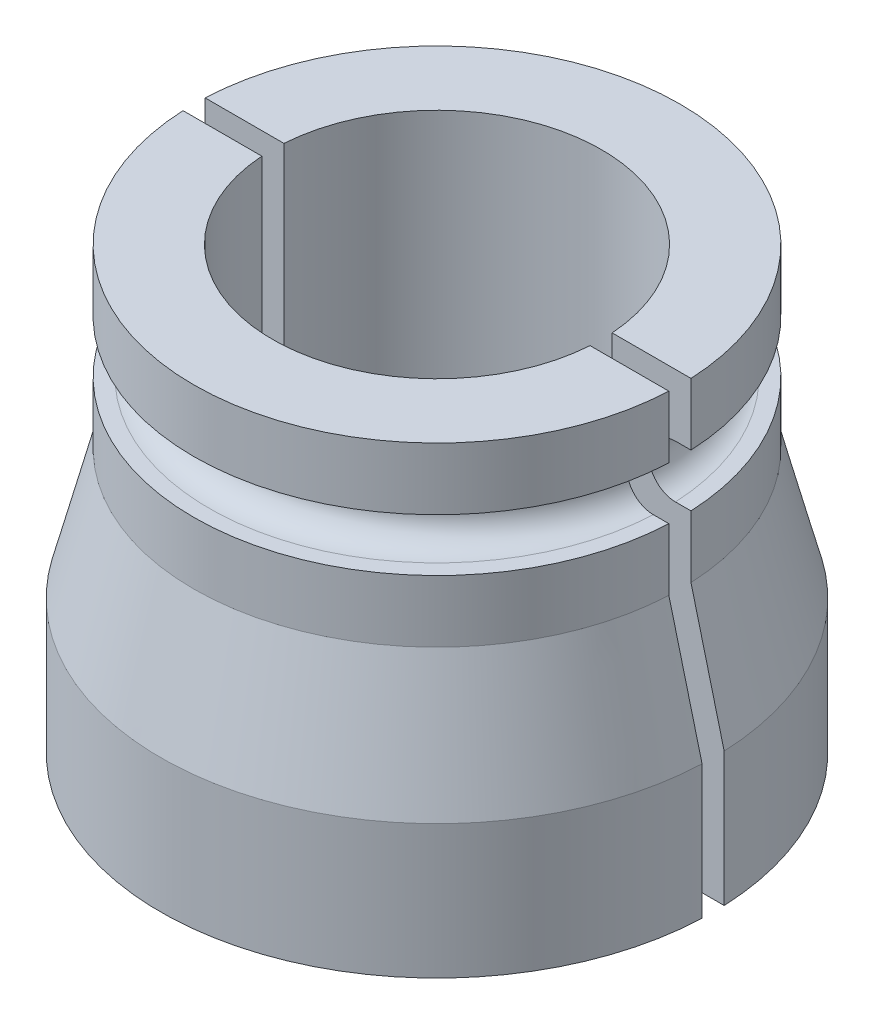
ISO-10303-21;
HEADER;
FILE_DESCRIPTION(('STEP AP214'),'2;1');
FILE_NAME('part.step','',(''),(''),'','','');
FILE_SCHEMA(('AUTOMOTIVE_DESIGN { 1 0 10303 214 1 1 1 1 }'));
ENDSEC;
DATA;
#1=APPLICATION_CONTEXT('core data for automotive mechanical design processes');
#2=APPLICATION_PROTOCOL_DEFINITION('international standard','automotive_design',2000,#1);
#3=PRODUCT_CONTEXT('',#1,'mechanical');
#4=PRODUCT('Part','Part','',(#3));
#5=PRODUCT_RELATED_PRODUCT_CATEGORY('part','',(#4));
#6=PRODUCT_DEFINITION_FORMATION('','',#4);
#7=PRODUCT_DEFINITION_CONTEXT('part definition',#1,'design');
#8=PRODUCT_DEFINITION('design','',#6,#7);
#9=PRODUCT_DEFINITION_SHAPE('','',#8);
#10=(LENGTH_UNIT() NAMED_UNIT(*) SI_UNIT(.MILLI.,.METRE.));
#11=(NAMED_UNIT(*) PLANE_ANGLE_UNIT() SI_UNIT($,.RADIAN.));
#12=(NAMED_UNIT(*) SI_UNIT($,.STERADIAN.) SOLID_ANGLE_UNIT());
#13=UNCERTAINTY_MEASURE_WITH_UNIT(LENGTH_MEASURE(1.E-05),#10,'distance_accuracy_value','');
#14=(GEOMETRIC_REPRESENTATION_CONTEXT(3) GLOBAL_UNCERTAINTY_ASSIGNED_CONTEXT((#13)) GLOBAL_UNIT_ASSIGNED_CONTEXT((#10,
#11,#12)) REPRESENTATION_CONTEXT('',''));
#15=CARTESIAN_POINT('',(0.,0.,0.));
#16=DIRECTION('',(0.,0.,1.));
#17=DIRECTION('',(1.,0.,0.));
#18=AXIS2_PLACEMENT_3D('',#15,#16,#17);
#19=CARTESIAN_POINT('',(0.,0.,0.));
#20=DIRECTION('',(0.,-1.,0.));
#21=DIRECTION('',(0.,0.,-1.));
#22=AXIS2_PLACEMENT_3D('',#19,#20,#21);
#23=CYLINDRICAL_SURFACE('',#22,11.);
#24=CARTESIAN_POINT('',(0.,14.709375,0.));
#25=DIRECTION('',(0.,1.,0.));
#26=DIRECTION('',(0.,0.,1.));
#27=AXIS2_PLACEMENT_3D('',#24,#25,#26);
#28=CIRCLE('',#27,11.);
#29=CARTESIAN_POINT('',(10.988630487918,14.709375,-0.5));
#30=VERTEX_POINT('',#29);
#31=CARTESIAN_POINT('',(-10.988630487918,14.709375,-0.5));
#32=VERTEX_POINT('',#31);
#33=EDGE_CURVE('E158',#30,#32,#28,.T.);
#34=ORIENTED_EDGE('',*,*,#33,.F.);
#35=DIRECTION('',(0.,-1.,0.));
#36=VECTOR('',#35,1.);
#37=CARTESIAN_POINT('',(10.988630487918,0.,-0.5));
#38=LINE('',#37,#36);
#39=CARTESIAN_POINT('',(10.988630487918,11.9,-0.5));
#40=VERTEX_POINT('',#39);
#41=EDGE_CURVE('E222',#30,#40,#38,.T.);
#42=ORIENTED_EDGE('',*,*,#41,.T.);
#43=CARTESIAN_POINT('',(0.,11.9,0.));
#44=DIRECTION('',(0.,-1.,0.));
#45=DIRECTION('',(0.,0.,-1.));
#46=AXIS2_PLACEMENT_3D('',#43,#44,#45);
#47=CIRCLE('',#46,11.);
#48=CARTESIAN_POINT('',(-10.988630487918,11.9,-0.5));
#49=VERTEX_POINT('',#48);
#50=EDGE_CURVE('E221',#49,#40,#47,.T.);
#51=ORIENTED_EDGE('',*,*,#50,.F.);
#52=DIRECTION('',(0.,-1.,0.));
#53=VECTOR('',#52,1.);
#54=CARTESIAN_POINT('',(-10.988630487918,0.,-0.5));
#55=LINE('',#54,#53);
#56=EDGE_CURVE('E273',#49,#32,#55,.F.);
#57=ORIENTED_EDGE('',*,*,#56,.T.);
#58=EDGE_LOOP('',(#34,#42,#51,#57));
#59=FACE_BOUND('',#58,.T.);
#60=ADVANCED_FACE('F46',(#59),#23,.T.);
#61=CARTESIAN_POINT('',(0.,0.,0.));
#62=DIRECTION('',(0.,-1.,0.));
#63=DIRECTION('',(0.,0.,-1.));
#64=AXIS2_PLACEMENT_3D('',#61,#62,#63);
#65=PLANE('',#64);
#66=DIRECTION('',(1.,0.,0.));
#67=VECTOR('',#66,1.);
#68=CARTESIAN_POINT('',(-12.5,0.,-0.5));
#69=LINE('',#68,#67);
#70=CARTESIAN_POINT('',(-12.4899959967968,0.,-0.5));
#71=VERTEX_POINT('',#70);
#72=CARTESIAN_POINT('',(-10.988630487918,0.,-0.5));
#73=VERTEX_POINT('',#72);
#74=EDGE_CURVE('E264',#71,#73,#69,.T.);
#75=ORIENTED_EDGE('',*,*,#74,.F.);
#76=CARTESIAN_POINT('',(0.,0.,0.));
#77=DIRECTION('',(0.,-1.,0.));
#78=DIRECTION('',(0.,0.,-1.));
#79=AXIS2_PLACEMENT_3D('',#76,#77,#78);
#80=CIRCLE('',#79,12.5);
#81=CARTESIAN_POINT('',(12.4899959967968,0.,-0.5));
#82=VERTEX_POINT('',#81);
#83=EDGE_CURVE('E269',#71,#82,#80,.T.);
#84=ORIENTED_EDGE('',*,*,#83,.T.);
#85=CARTESIAN_POINT('',(10.988630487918,0.,-0.5));
#86=VERTEX_POINT('',#85);
#87=EDGE_CURVE('E265',#86,#82,#69,.T.);
#88=ORIENTED_EDGE('',*,*,#87,.F.);
#89=CARTESIAN_POINT('',(0.,0.,0.));
#90=DIRECTION('',(0.,-1.,0.));
#91=DIRECTION('',(0.,0.,-1.));
#92=AXIS2_PLACEMENT_3D('',#89,#90,#91);
#93=CIRCLE('',#92,11.);
#94=EDGE_CURVE('E134',#73,#86,#93,.T.);
#95=ORIENTED_EDGE('',*,*,#94,.F.);
#96=EDGE_LOOP('',(#75,#84,#88,#95));
#97=FACE_BOUND('',#96,.T.);
#98=ADVANCED_FACE('F48',(#97),#65,.T.);
#99=CARTESIAN_POINT('',(0.,0.,0.));
#100=DIRECTION('',(0.,-1.,0.));
#101=DIRECTION('',(0.,0.,-1.));
#102=AXIS2_PLACEMENT_3D('',#99,#100,#101);
#103=CYLINDRICAL_SURFACE('',#102,12.5);
#104=DIRECTION('',(0.,-1.,0.));
#105=VECTOR('',#104,1.);
#106=CARTESIAN_POINT('',(12.4899959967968,0.,-0.5));
#107=LINE('',#106,#105);
#108=CARTESIAN_POINT('',(12.4899959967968,6.04999999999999,-0.5));
#109=VERTEX_POINT('',#108);
#110=EDGE_CURVE('E184',#82,#109,#107,.F.);
#111=ORIENTED_EDGE('',*,*,#110,.F.);
#112=ORIENTED_EDGE('',*,*,#83,.F.);
#113=DIRECTION('',(0.,-1.,0.));
#114=VECTOR('',#113,1.);
#115=CARTESIAN_POINT('',(-12.4899959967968,0.,-0.5));
#116=LINE('',#115,#114);
#117=CARTESIAN_POINT('',(-12.4899959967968,6.04999999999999,-0.5));
#118=VERTEX_POINT('',#117);
#119=EDGE_CURVE('E263',#118,#71,#116,.T.);
#120=ORIENTED_EDGE('',*,*,#119,.F.);
#121=CARTESIAN_POINT('',(0.,6.04999999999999,0.));
#122=DIRECTION('',(0.,-1.,0.));
#123=DIRECTION('',(0.,0.,-1.));
#124=AXIS2_PLACEMENT_3D('',#121,#122,#123);
#125=CIRCLE('',#124,12.5);
#126=EDGE_CURVE('E272',#118,#109,#125,.T.);
#127=ORIENTED_EDGE('',*,*,#126,.T.);
#128=EDGE_LOOP('',(#111,#112,#120,#127));
#129=FACE_BOUND('',#128,.T.);
#130=ADVANCED_FACE('F228',(#129),#103,.T.);
#131=CARTESIAN_POINT('',(0.,11.9,0.));
#132=DIRECTION('',(0.,-1.,0.));
#133=DIRECTION('',(0.,0.,-1.));
#134=AXIS2_PLACEMENT_3D('',#131,#132,#133);
#135=CONICAL_SURFACE('',#134,11.,0.251002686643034);
#136=ORIENTED_EDGE('',*,*,#126,.F.);
#137=CARTESIAN_POINT('',(-16.2134813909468,-8.46263785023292,-0.5));
#138=CARTESIAN_POINT('',(-15.4435594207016,-5.46140460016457,-0.5));
#139=CARTESIAN_POINT('',(-14.6736046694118,-2.46017975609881,-0.5));
#140=CARTESIAN_POINT('',(-13.1335357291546,3.54222898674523,-0.5));
#141=CARTESIAN_POINT('',(-12.363421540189,6.54341288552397,-0.5));
#142=CARTESIAN_POINT('',(-10.8229398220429,12.5457157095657,-0.5));
#143=CARTESIAN_POINT('',(-10.0525722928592,15.5468346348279,-0.5));
#144=CARTESIAN_POINT('',(-8.89664737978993,20.048417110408,-0.5));
#145=CARTESIAN_POINT('',(-8.51127680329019,21.5489286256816,-0.5));
#146=CARTESIAN_POINT('',(-7.74033752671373,24.5499007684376,-0.5));
#147=CARTESIAN_POINT('',(-7.35476882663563,26.0503613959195,-0.5));
#148=CARTESIAN_POINT('',(-6.96906427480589,27.5507871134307,-0.5));
#149=B_SPLINE_CURVE_WITH_KNOTS('',3,(#137,#138,#139,#140,#141,#142,#143,#144,#145,#146,#147,
#148),.UNSPECIFIED.,.F.,.F.,(4,2,2,2,2,4),(0.,9.29524759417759,18.5904950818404,
27.8857426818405,32.5333665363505,37.1809904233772),.UNSPECIFIED.);
#150=EDGE_CURVE('E205',#118,#49,#149,.T.);
#151=ORIENTED_EDGE('',*,*,#150,.T.);
#152=ORIENTED_EDGE('',*,*,#50,.T.);
#153=CARTESIAN_POINT('',(6.96906427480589,27.5507871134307,-0.5));
#154=CARTESIAN_POINT('',(7.43353889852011,25.7439121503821,-0.5));
#155=CARTESIAN_POINT('',(7.8978257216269,23.9369889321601,-0.5));
#156=CARTESIAN_POINT('',(8.82613367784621,20.3230742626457,-0.5));
#157=CARTESIAN_POINT('',(9.29015481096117,18.5160828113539,-0.5));
#158=CARTESIAN_POINT('',(10.3672435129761,14.3209326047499,-0.5));
#159=CARTESIAN_POINT('',(10.9802529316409,11.9327589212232,-0.5));
#160=CARTESIAN_POINT('',(12.3634230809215,6.5434132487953,-0.5));
#161=CARTESIAN_POINT('',(13.1335365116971,3.5422291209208,-0.5));
#162=CARTESIAN_POINT('',(14.6736039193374,-2.46018001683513,-0.5));
#163=CARTESIAN_POINT('',(15.4435578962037,-5.46140502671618,-0.5));
#164=CARTESIAN_POINT('',(16.2134813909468,-8.46263785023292,-0.5));
#165=B_SPLINE_CURVE_WITH_KNOTS('',3,(#153,#154,#155,#156,#157,#158,#159,#160,#161,#162,#163,
#164),.UNSPECIFIED.,.F.,.F.,(4,2,2,2,2,4),(0.,5.59685660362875,11.1937131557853,18.590495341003,
27.8857429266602,37.1809904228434),.UNSPECIFIED.);
#166=EDGE_CURVE('E215',#40,#109,#165,.T.);
#167=ORIENTED_EDGE('',*,*,#166,.T.);
#168=EDGE_LOOP('',(#136,#151,#152,#167));
#169=FACE_BOUND('',#168,.T.);
#170=ADVANCED_FACE('F223',(#169),#135,.T.);
#171=CARTESIAN_POINT('',(0.,19.9,0.));
#172=DIRECTION('',(0.,-1.,0.));
#173=DIRECTION('',(0.,0.,-1.));
#174=AXIS2_PLACEMENT_3D('',#171,#172,#173);
#175=CIRCLE('',#174,11.);
#176=CARTESIAN_POINT('',(-10.988630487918,19.9,-0.5));
#177=VERTEX_POINT('',#176);
#178=CARTESIAN_POINT('',(10.988630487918,19.9,-0.5));
#179=VERTEX_POINT('',#178);
#180=EDGE_CURVE('E143',#177,#179,#175,.T.);
#181=ORIENTED_EDGE('',*,*,#180,.T.);
#182=DIRECTION('',(0.,-1.,0.));
#183=VECTOR('',#182,1.);
#184=CARTESIAN_POINT('',(10.988630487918,0.,-0.5));
#185=LINE('',#184,#183);
#186=CARTESIAN_POINT('',(10.988630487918,17.090625,-0.5));
#187=VERTEX_POINT('',#186);
#188=EDGE_CURVE('E252',#179,#187,#185,.T.);
#189=ORIENTED_EDGE('',*,*,#188,.T.);
#190=CARTESIAN_POINT('',(0.,17.090625,0.));
#191=DIRECTION('',(0.,1.,0.));
#192=DIRECTION('',(0.,0.,1.));
#193=AXIS2_PLACEMENT_3D('',#190,#191,#192);
#194=CIRCLE('',#193,11.);
#195=CARTESIAN_POINT('',(-10.988630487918,17.090625,-0.5));
#196=VERTEX_POINT('',#195);
#197=EDGE_CURVE('E50',#187,#196,#194,.T.);
#198=ORIENTED_EDGE('',*,*,#197,.T.);
#199=DIRECTION('',(0.,-1.,0.));
#200=VECTOR('',#199,1.);
#201=CARTESIAN_POINT('',(-10.988630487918,0.,-0.5));
#202=LINE('',#201,#200);
#203=EDGE_CURVE('E148',#196,#177,#202,.F.);
#204=ORIENTED_EDGE('',*,*,#203,.T.);
#205=EDGE_LOOP('',(#181,#189,#198,#204));
#206=FACE_BOUND('',#205,.T.);
#207=ADVANCED_FACE('F227',(#206),#23,.T.);
#208=CARTESIAN_POINT('',(0.,19.9,0.));
#209=DIRECTION('',(0.,-1.,0.));
#210=DIRECTION('',(0.,0.,-1.));
#211=AXIS2_PLACEMENT_3D('',#208,#209,#210);
#212=PLANE('',#211);
#213=ORIENTED_EDGE('',*,*,#180,.F.);
#214=DIRECTION('',(-1.,0.,0.));
#215=VECTOR('',#214,1.);
#216=CARTESIAN_POINT('',(-12.5,19.9,-0.5));
#217=LINE('',#216,#215);
#218=CARTESIAN_POINT('',(-7.42317991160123,19.9,-0.5));
#219=VERTEX_POINT('',#218);
#220=EDGE_CURVE('E58',#219,#177,#217,.T.);
#221=ORIENTED_EDGE('',*,*,#220,.F.);
#222=CARTESIAN_POINT('',(0.,19.9,0.));
#223=DIRECTION('',(0.,-1.,0.));
#224=DIRECTION('',(0.,0.,-1.));
#225=AXIS2_PLACEMENT_3D('',#222,#223,#224);
#226=CIRCLE('',#225,7.44);
#227=CARTESIAN_POINT('',(7.42317991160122,19.9,-0.5));
#228=VERTEX_POINT('',#227);
#229=EDGE_CURVE('E141',#219,#228,#226,.T.);
#230=ORIENTED_EDGE('',*,*,#229,.T.);
#231=EDGE_CURVE('E12',#179,#228,#217,.T.);
#232=ORIENTED_EDGE('',*,*,#231,.F.);
#233=EDGE_LOOP('',(#213,#221,#230,#232));
#234=FACE_BOUND('',#233,.T.);
#235=ADVANCED_FACE('F139',(#234),#212,.F.);
#236=CARTESIAN_POINT('',(0.,0.,0.));
#237=DIRECTION('',(0.,-1.,0.));
#238=DIRECTION('',(0.,0.,-1.));
#239=AXIS2_PLACEMENT_3D('',#236,#237,#238);
#240=CYLINDRICAL_SURFACE('',#239,7.44);
#241=CARTESIAN_POINT('',(0.,6.16610087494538,0.));
#242=DIRECTION('',(0.,-1.,0.));
#243=DIRECTION('',(0.,0.,-1.));
#244=AXIS2_PLACEMENT_3D('',#241,#242,#243);
#245=CIRCLE('',#244,7.44);
#246=CARTESIAN_POINT('',(-7.42317991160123,6.16610087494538,-0.5));
#247=VERTEX_POINT('',#246);
#248=CARTESIAN_POINT('',(7.42317991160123,6.16610087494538,-0.5));
#249=VERTEX_POINT('',#248);
#250=EDGE_CURVE('E147',#247,#249,#245,.T.);
#251=ORIENTED_EDGE('',*,*,#250,.T.);
#252=DIRECTION('',(0.,-1.,0.));
#253=VECTOR('',#252,1.);
#254=CARTESIAN_POINT('',(7.42317991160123,0.,-0.5));
#255=LINE('',#254,#253);
#256=EDGE_CURVE('E65',#249,#228,#255,.F.);
#257=ORIENTED_EDGE('',*,*,#256,.T.);
#258=ORIENTED_EDGE('',*,*,#229,.F.);
#259=DIRECTION('',(0.,-1.,0.));
#260=VECTOR('',#259,1.);
#261=CARTESIAN_POINT('',(-7.42317991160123,0.,-0.5));
#262=LINE('',#261,#260);
#263=EDGE_CURVE('E123',#219,#247,#262,.T.);
#264=ORIENTED_EDGE('',*,*,#263,.T.);
#265=EDGE_LOOP('',(#251,#257,#258,#264));
#266=FACE_BOUND('',#265,.T.);
#267=ADVANCED_FACE('F146',(#266),#240,.F.);
#268=CARTESIAN_POINT('',(0.,0.,0.));
#269=DIRECTION('',(0.,-1.,0.));
#270=DIRECTION('',(0.,0.,-1.));
#271=AXIS2_PLACEMENT_3D('',#268,#269,#270);
#272=CONICAL_SURFACE('',#271,11.,0.523598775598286);
#273=ORIENTED_EDGE('',*,*,#94,.T.);
#274=CARTESIAN_POINT('',(18.9082069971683,-13.7088647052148,-0.5));
#275=CARTESIAN_POINT('',(17.8570632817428,-11.8888916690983,-0.5));
#276=CARTESIAN_POINT('',(16.8058945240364,-10.068933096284,-0.5));
#277=CARTESIAN_POINT('',(14.7033898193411,-6.42910838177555,-0.5));
#278=CARTESIAN_POINT('',(13.6520538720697,-4.60924224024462,-0.5));
#279=CARTESIAN_POINT('',(11.5491714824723,-0.969793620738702,-0.5));
#280=CARTESIAN_POINT('',(10.4976250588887,0.849788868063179,-0.5));
#281=CARTESIAN_POINT('',(8.91978310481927,3.57885880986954,-0.5));
#282=CARTESIAN_POINT('',(8.39374912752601,4.48849747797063,-0.5));
#283=CARTESIAN_POINT('',(7.34137755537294,6.30759915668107,-0.5));
#284=CARTESIAN_POINT('',(6.815039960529,7.21706216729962,-0.5));
#285=CARTESIAN_POINT('',(6.025148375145,8.58088391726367,-0.5));
#286=CARTESIAN_POINT('',(5.76181947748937,9.03537301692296,-0.5));
#287=CARTESIAN_POINT('',(5.23493279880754,9.94422039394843,-0.5));
#288=CARTESIAN_POINT('',(4.97137501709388,10.3985786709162,-0.5));
#289=CARTESIAN_POINT('',(4.44388865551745,11.3071009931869,-0.5));
#290=CARTESIAN_POINT('',(4.17996006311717,11.7612650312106,-0.5));
#291=CARTESIAN_POINT('',(3.65149700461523,12.6692353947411,-0.5));
#292=CARTESIAN_POINT('',(3.38696254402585,13.1230417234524,-0.5));
#293=CARTESIAN_POINT('',(2.98925078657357,13.8032174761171,-0.5));
#294=CARTESIAN_POINT('',(2.85652890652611,14.0298531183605,-0.5));
#295=CARTESIAN_POINT('',(2.59061875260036,14.4828586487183,-0.5));
#296=CARTESIAN_POINT('',(2.45743046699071,14.7092285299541,-0.5));
#297=CARTESIAN_POINT('',(2.19032053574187,15.1615241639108,-0.5));
#298=CARTESIAN_POINT('',(2.05639891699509,15.3874499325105,-0.5));
#299=CARTESIAN_POINT('',(1.78731398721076,15.8385409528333,-0.5));
#300=CARTESIAN_POINT('',(1.65215077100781,16.0637062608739,-0.5));
#301=CARTESIAN_POINT('',(1.44754130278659,16.4002396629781,-0.5));
#302=CARTESIAN_POINT('',(1.37904628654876,16.5121847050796,-0.5));
#303=CARTESIAN_POINT('',(1.24105474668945,16.7354863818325,-0.5));
#304=CARTESIAN_POINT('',(1.1715580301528,16.8468428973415,-0.5));
#305=CARTESIAN_POINT('',(1.03092667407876,17.0686667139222,-0.5));
#306=CARTESIAN_POINT('',(0.95979062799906,17.1791331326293,-0.5));
#307=CARTESIAN_POINT('',(0.850925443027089,17.3433784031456,-0.5));
#308=CARTESIAN_POINT('',(0.81428290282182,17.3978758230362,-0.5));
#309=CARTESIAN_POINT('',(0.739955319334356,17.5061531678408,-0.5));
#310=CARTESIAN_POINT('',(0.702270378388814,17.5599331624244,-0.5));
#311=CARTESIAN_POINT('',(0.641668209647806,17.6437689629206,-0.5));
#312=CARTESIAN_POINT('',(0.619274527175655,17.6742024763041,-0.5));
#313=CARTESIAN_POINT('',(0.573802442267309,17.7345662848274,-0.5));
#314=CARTESIAN_POINT('',(0.550723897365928,17.764496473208,-0.5));
#315=CARTESIAN_POINT('',(0.503726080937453,17.8235606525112,-0.5));
#316=CARTESIAN_POINT('',(0.47980925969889,17.8526965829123,-0.5));
#317=CARTESIAN_POINT('',(0.430749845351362,17.9099110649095,-0.5));
#318=CARTESIAN_POINT('',(0.405607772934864,17.9379900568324,-0.5));
#319=CARTESIAN_POINT('',(0.358677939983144,17.9871396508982,-0.5));
#320=CARTESIAN_POINT('',(0.337200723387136,18.0085039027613,-0.5));
#321=CARTESIAN_POINT('',(0.292612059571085,18.04966677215,-0.5));
#322=CARTESIAN_POINT('',(0.269494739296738,18.0694591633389,-0.5));
#323=CARTESIAN_POINT('',(0.220760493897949,18.1066563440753,-0.5));
#324=CARTESIAN_POINT('',(0.195109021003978,18.1240170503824,-0.5));
#325=CARTESIAN_POINT('',(0.141100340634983,18.1537776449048,-0.5));
#326=CARTESIAN_POINT('',(0.112765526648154,18.1662147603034,-0.5));
#327=CARTESIAN_POINT('',(0.0667558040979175,18.1793037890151,-0.5));
#328=CARTESIAN_POINT('',(0.0498887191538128,18.1827340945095,-0.5));
#329=CARTESIAN_POINT('',(0.0158122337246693,18.1865985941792,-0.5));
#330=CARTESIAN_POINT('',(-0.00139687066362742,18.1870352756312,-0.5));
#331=CARTESIAN_POINT('',(-0.0355935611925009,18.1848471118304,-0.5));
#332=CARTESIAN_POINT('',(-0.0525813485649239,18.1822252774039,-0.5));
#333=CARTESIAN_POINT('',(-0.0859200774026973,18.1743079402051,-0.5));
#334=CARTESIAN_POINT('',(-0.102270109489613,18.1690087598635,-0.5));
#335=CARTESIAN_POINT('',(-0.144112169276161,18.1523421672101,-0.5));
#336=CARTESIAN_POINT('',(-0.168904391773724,18.1392534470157,-0.5));
#337=CARTESIAN_POINT('',(-0.216394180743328,18.1096949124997,-0.5));
#338=CARTESIAN_POINT('',(-0.239082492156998,18.0932110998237,-0.5));
#339=CARTESIAN_POINT('',(-0.279577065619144,18.0607539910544,-0.5));
#340=CARTESIAN_POINT('',(-0.297611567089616,18.0450597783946,-0.5));
#341=CARTESIAN_POINT('',(-0.332723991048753,18.0126281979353,-0.5));
#342=CARTESIAN_POINT('',(-0.349801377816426,17.9958902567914,-0.5));
#343=CARTESIAN_POINT('',(-0.399988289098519,17.9445142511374,-0.5));
#344=CARTESIAN_POINT('',(-0.431971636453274,17.9087836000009,-0.5));
#345=CARTESIAN_POINT('',(-0.494211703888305,17.8355192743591,-0.5));
#346=CARTESIAN_POINT('',(-0.524456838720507,17.797976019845,-0.5));
#347=CARTESIAN_POINT('',(-0.583591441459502,17.7219313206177,-0.5));
#348=CARTESIAN_POINT('',(-0.612482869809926,17.6834313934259,-0.5));
#349=CARTESIAN_POINT('',(-0.696906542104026,17.5681629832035,-0.5));
#350=CARTESIAN_POINT('',(-0.7511374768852,17.4904477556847,-0.5));
#351=CARTESIAN_POINT('',(-0.857669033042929,17.333698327,-0.5));
#352=CARTESIAN_POINT('',(-0.909969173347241,17.2546638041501,-0.5));
#353=CARTESIAN_POINT('',(-1.01340491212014,17.0957098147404,-0.5));
#354=CARTESIAN_POINT('',(-1.06453912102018,17.0157894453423,-0.5));
#355=CARTESIAN_POINT('',(-1.16598890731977,16.8554452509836,-0.5));
#356=CARTESIAN_POINT('',(-1.21630457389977,16.7750214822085,-0.5));
#357=CARTESIAN_POINT('',(-1.31612221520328,16.6142128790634,-0.5));
#358=CARTESIAN_POINT('',(-1.36562695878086,16.5338297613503,-0.5));
#359=CARTESIAN_POINT('',(-1.46422494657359,16.3728088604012,-0.5));
#360=CARTESIAN_POINT('',(-1.51331817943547,16.2921710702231,-0.5));
#361=CARTESIAN_POINT('',(-1.66008311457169,16.0500711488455,-0.5));
#362=CARTESIAN_POINT('',(-1.75729631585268,15.8883312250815,-0.5));
#363=CARTESIAN_POINT('',(-1.95088255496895,15.5645860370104,-0.5));
#364=CARTESIAN_POINT('',(-2.04725638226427,15.402581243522,-0.5));
#365=CARTESIAN_POINT('',(-2.23951606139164,15.0782822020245,-0.5));
#366=CARTESIAN_POINT('',(-2.33540191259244,14.9159879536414,-0.5));
#367=CARTESIAN_POINT('',(-2.62256701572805,14.4288106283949,-0.5));
#368=CARTESIAN_POINT('',(-2.81335183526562,14.1036363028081,-0.5));
#369=CARTESIAN_POINT('',(-3.19426967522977,13.4528062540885,-0.5));
#370=CARTESIAN_POINT('',(-3.3844025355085,13.1271504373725,-0.5));
#371=CARTESIAN_POINT('',(-3.76424235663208,12.4755926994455,-0.5));
#372=CARTESIAN_POINT('',(-3.95394931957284,12.1496907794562,-0.5));
#373=CARTESIAN_POINT('',(-4.33345531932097,11.4970997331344,-0.5));
#374=CARTESIAN_POINT('',(-4.52325382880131,11.1704103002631,-0.5));
#375=CARTESIAN_POINT('',(-4.90266249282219,10.5169215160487,-0.5));
#376=CARTESIAN_POINT('',(-5.09227264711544,10.190122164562,-0.5));
#377=CARTESIAN_POINT('',(-5.66087559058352,9.20965966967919,-0.5));
#378=CARTESIAN_POINT('',(-6.0396701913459,8.55588160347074,-0.5));
#379=CARTESIAN_POINT('',(-6.94056302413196,7.0002005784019,-0.5));
#380=CARTESIAN_POINT('',(-7.46253112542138,6.09822228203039,-0.5));
#381=CARTESIAN_POINT('',(-8.50617897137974,4.2940986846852,-0.5));
#382=CARTESIAN_POINT('',(-9.02785871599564,3.39195338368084,-0.5));
#383=CARTESIAN_POINT('',(-10.5926833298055,0.685314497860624,-0.5));
#384=CARTESIAN_POINT('',(-11.6355793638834,-1.1193229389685,-0.5));
#385=CARTESIAN_POINT('',(-13.7168643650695,-4.72142607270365,-0.5));
#386=CARTESIAN_POINT('',(-14.755254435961,-6.51889113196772,-0.5));
#387=CARTESIAN_POINT('',(-16.8318402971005,-10.113854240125,-0.5));
#388=CARTESIAN_POINT('',(-17.8700360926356,-11.911352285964,-0.5));
#389=CARTESIAN_POINT('',(-18.9082069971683,-13.7088647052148,-0.5));
#390=B_SPLINE_CURVE_WITH_KNOTS('',3,(#274,#275,#276,#277,#278,#279,#280,#281,#282,#283,#284,
#285,#286,#287,#288,#289,#290,#291,#292,#293,#294,#295,#296,#297,#298,#299,#300,#301,#302,#303,
#304,#305,#306,#307,#308,#309,#310,#311,#312,#313,#314,#315,#316,#317,#318,#319,#320,#321,#322,
#323,#324,#325,#326,#327,#328,#329,#330,#331,#332,#333,#334,#335,#336,#337,#338,#339,#340,#341,
#342,#343,#344,#345,#346,#347,#348,#349,#350,#351,#352,#353,#354,#355,#356,#357,#358,#359,#360,
#361,#362,#363,#364,#365,#366,#367,#368,#369,#370,#371,#372,#373,#374,#375,#376,#377,#378,#379,
#380,#381,#382,#383,#384,#385,#386,#387,#388,#389),.UNSPECIFIED.,.F.,.F.,(4,2,2,2,2,2,2,2,2,2,2,
2,2,2,2,2,2,2,2,2,2,2,2,2,2,2,2,2,2,2,2,2,2,2,2,2,2,2,2,2,2,2,2,2,2,2,2,2,2,2,2,2,2,2,2,2,2,4),
(0.,6.30514429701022,12.6102993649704,18.9150334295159,22.0673957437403,25.2197578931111,
26.7955503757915,28.3713476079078,29.947199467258,31.5230370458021,32.3109512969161,
33.098885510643,33.8867910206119,34.6746368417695,35.0683452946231,35.4621306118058,
35.8562673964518,36.053272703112,36.2502587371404,36.3636058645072,36.4769767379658,
36.5900400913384,36.7030558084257,36.79388344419,36.8850545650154,36.9777089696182,
37.0696487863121,37.1210543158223,37.1724171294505,37.2237294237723,37.2751123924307,
37.358731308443,37.442702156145,37.5143694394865,37.5860764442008,37.7298093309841,
37.8744096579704,38.0187936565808,38.3030283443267,38.5873333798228,38.8719611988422,
39.1565577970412,39.4397688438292,39.7229876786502,40.2891037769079,40.8546125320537,
41.4201220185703,42.5511526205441,43.6824435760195,44.8137289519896,45.9471948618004,
47.0806622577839,49.3474218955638,52.4737838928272,55.6001464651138,61.8530765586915,
68.0806130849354,74.3079437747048),.UNSPECIFIED.);
#391=EDGE_CURVE('E157',#86,#249,#390,.T.);
#392=ORIENTED_EDGE('',*,*,#391,.T.);
#393=ORIENTED_EDGE('',*,*,#250,.F.);
#394=EDGE_CURVE('E129',#247,#73,#390,.T.);
#395=ORIENTED_EDGE('',*,*,#394,.T.);
#396=EDGE_LOOP('',(#273,#392,#393,#395));
#397=FACE_BOUND('',#396,.T.);
#398=ADVANCED_FACE('F186',(#397),#272,.F.);
#399=CARTESIAN_POINT('',(0.,14.709375,0.));
#400=DIRECTION('',(0.,1.,0.));
#401=DIRECTION('',(0.,0.,1.));
#402=AXIS2_PLACEMENT_3D('',#399,#400,#401);
#403=PLANE('',#402);
#404=DIRECTION('',(-1.,0.,0.));
#405=VECTOR('',#404,1.);
#406=CARTESIAN_POINT('',(0.,14.709375,-0.5));
#407=LINE('',#406,#405);
#408=CARTESIAN_POINT('',(10.2878569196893,14.709375,-0.5));
#409=VERTEX_POINT('',#408);
#410=EDGE_CURVE('E56',#30,#409,#407,.T.);
#411=ORIENTED_EDGE('',*,*,#410,.F.);
#412=ORIENTED_EDGE('',*,*,#33,.T.);
#413=CARTESIAN_POINT('',(-10.2878569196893,14.709375,-0.5));
#414=VERTEX_POINT('',#413);
#415=EDGE_CURVE('E144',#414,#32,#407,.T.);
#416=ORIENTED_EDGE('',*,*,#415,.F.);
#417=CARTESIAN_POINT('',(0.,14.709375,0.));
#418=DIRECTION('',(0.,1.,0.));
#419=DIRECTION('',(0.,0.,1.));
#420=AXIS2_PLACEMENT_3D('',#417,#418,#419);
#421=CIRCLE('',#420,10.3);
#422=EDGE_CURVE('E161',#409,#414,#421,.T.);
#423=ORIENTED_EDGE('',*,*,#422,.F.);
#424=EDGE_LOOP('',(#411,#412,#416,#423));
#425=FACE_BOUND('',#424,.T.);
#426=ADVANCED_FACE('F261',(#425),#403,.T.);
#427=CARTESIAN_POINT('',(0.,15.9,0.));
#428=DIRECTION('',(0.,1.,0.));
#429=DIRECTION('',(0.,0.,1.));
#430=AXIS2_PLACEMENT_3D('',#427,#428,#429);
#431=TOROIDAL_SURFACE('',#430,10.3,1.190625);
#432=ORIENTED_EDGE('',*,*,#422,.T.);
#433=CARTESIAN_POINT('',(-9.89780746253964,14.7749124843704,-0.5));
#434=CARTESIAN_POINT('',(-9.83450795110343,14.7968057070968,-0.5));
#435=CARTESIAN_POINT('',(-9.77301000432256,14.8240564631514,-0.5));
#436=CARTESIAN_POINT('',(-9.65540934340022,14.8885165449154,-0.5));
#437=CARTESIAN_POINT('',(-9.5993131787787,14.9257377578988,-0.5));
#438=CARTESIAN_POINT('',(-9.49418813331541,15.0090610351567,-0.5));
#439=CARTESIAN_POINT('',(-9.44515622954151,15.055159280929,-0.5));
#440=CARTESIAN_POINT('',(-9.35554998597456,15.1549278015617,-0.5));
#441=CARTESIAN_POINT('',(-9.31497352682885,15.2085961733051,-0.5));
#442=CARTESIAN_POINT('',(-9.24345003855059,15.3219469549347,-0.5));
#443=CARTESIAN_POINT('',(-9.21249541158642,15.3816245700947,-0.5));
#444=CARTESIAN_POINT('',(-9.16105902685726,15.5053369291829,-0.5));
#445=CARTESIAN_POINT('',(-9.14057759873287,15.569371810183,-0.5));
#446=CARTESIAN_POINT('',(-9.1106981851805,15.6998848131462,-0.5));
#447=CARTESIAN_POINT('',(-9.10128507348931,15.7663594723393,-0.5));
#448=CARTESIAN_POINT('',(-9.0937617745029,15.8999450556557,-0.5));
#449=CARTESIAN_POINT('',(-9.09565150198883,15.9670559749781,-0.5));
#450=CARTESIAN_POINT('',(-9.11067385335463,16.0999572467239,-0.5));
#451=CARTESIAN_POINT('',(-9.12379822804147,16.1657485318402,-0.5));
#452=CARTESIAN_POINT('',(-9.16090264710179,16.2941948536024,-0.5));
#453=CARTESIAN_POINT('',(-9.18488267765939,16.3568498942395,-0.5));
#454=CARTESIAN_POINT('',(-9.24302210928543,16.477269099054,-0.5));
#455=CARTESIAN_POINT('',(-9.27718482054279,16.5350316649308,-0.5));
#456=CARTESIAN_POINT('',(-9.35471204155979,16.6440105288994,-0.5));
#457=CARTESIAN_POINT('',(-9.39807661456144,16.6952267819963,-0.5));
#458=CARTESIAN_POINT('',(-9.4928304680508,16.7897248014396,-0.5));
#459=CARTESIAN_POINT('',(-9.54422918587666,16.8329971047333,-0.5));
#460=CARTESIAN_POINT('',(-9.65355355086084,16.9103124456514,-0.5));
#461=CARTESIAN_POINT('',(-9.71147924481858,16.9443554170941,-0.5));
#462=CARTESIAN_POINT('',(-9.83229784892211,17.0022930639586,-0.5));
#463=CARTESIAN_POINT('',(-9.89519737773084,17.0261739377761,-0.5));
#464=CARTESIAN_POINT('',(-10.0241110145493,17.0630469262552,-0.5));
#465=CARTESIAN_POINT('',(-10.0901251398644,17.0760389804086,-0.5));
#466=CARTESIAN_POINT('',(-10.2234535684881,17.0907733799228,-0.5));
#467=CARTESIAN_POINT('',(-10.2907689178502,17.0925062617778,-0.5));
#468=CARTESIAN_POINT('',(-10.4247353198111,17.0846466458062,-0.5));
#469=CARTESIAN_POINT('',(-10.4913863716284,17.0750541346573,-0.5));
#470=CARTESIAN_POINT('',(-10.6221331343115,17.0448124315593,-0.5));
#471=CARTESIAN_POINT('',(-10.6862287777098,17.0241629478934,-0.5));
#472=CARTESIAN_POINT('',(-10.8100400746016,16.9723892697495,-0.5));
#473=CARTESIAN_POINT('',(-10.8697557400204,16.9412651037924,-0.5));
#474=CARTESIAN_POINT('',(-10.9830684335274,16.8694462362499,-0.5));
#475=CARTESIAN_POINT('',(-11.0366695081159,16.8287579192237,-0.5));
#476=CARTESIAN_POINT('',(-11.1362712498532,16.7389517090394,-0.5));
#477=CARTESIAN_POINT('',(-11.1822719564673,16.689833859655,-0.5));
#478=CARTESIAN_POINT('',(-11.2653183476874,16.5846151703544,-0.5));
#479=CARTESIAN_POINT('',(-11.302372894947,16.5285213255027,-0.5));
#480=CARTESIAN_POINT('',(-11.3665285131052,16.4109043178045,-0.5));
#481=CARTESIAN_POINT('',(-11.393629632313,16.3493811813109,-0.5));
#482=CARTESIAN_POINT('',(-11.4370838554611,16.222713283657,-0.5));
#483=CARTESIAN_POINT('',(-11.4534468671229,16.1575719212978,-0.5));
#484=CARTESIAN_POINT('',(-11.4749976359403,16.0254662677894,-0.5));
#485=CARTESIAN_POINT('',(-11.4801854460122,15.9585019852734,-0.5));
#486=CARTESIAN_POINT('',(-11.4792380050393,15.8246904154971,-0.5));
#487=CARTESIAN_POINT('',(-11.4731089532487,15.7578430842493,-0.5));
#488=CARTESIAN_POINT('',(-11.4497148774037,15.6261262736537,-0.5));
#489=CARTESIAN_POINT('',(-11.4324498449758,15.5612567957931,-0.5));
#490=CARTESIAN_POINT('',(-11.3872764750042,15.4353370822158,-0.5));
#491=CARTESIAN_POINT('',(-11.3593682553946,15.3742868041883,-0.5));
#492=CARTESIAN_POINT('',(-11.2937036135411,15.2577346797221,-0.5));
#493=CARTESIAN_POINT('',(-11.2559471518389,15.2022328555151,-0.5));
#494=CARTESIAN_POINT('',(-11.1716371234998,15.0983195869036,-0.5));
#495=CARTESIAN_POINT('',(-11.1250787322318,15.0499120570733,-0.5));
#496=CARTESIAN_POINT('',(-11.0245041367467,14.9615938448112,-0.5));
#497=CARTESIAN_POINT('',(-10.9704881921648,14.9216828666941,-0.5));
#498=CARTESIAN_POINT('',(-10.8564844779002,14.8514522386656,-0.5));
#499=CARTESIAN_POINT('',(-10.7964919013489,14.821140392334,-0.5));
#500=CARTESIAN_POINT('',(-10.6722561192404,14.7710002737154,-0.5));
#501=CARTESIAN_POINT('',(-10.6080118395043,14.7511746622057,-0.5));
#502=CARTESIAN_POINT('',(-10.4770185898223,14.7225526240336,-0.5));
#503=CARTESIAN_POINT('',(-10.4102660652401,14.7137725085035,-0.5));
#504=CARTESIAN_POINT('',(-10.2762898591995,14.7075525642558,-0.5));
#505=CARTESIAN_POINT('',(-10.2090668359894,14.7100991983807,-0.5));
#506=CARTESIAN_POINT('',(-10.1009271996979,14.7233564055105,-0.5));
#507=CARTESIAN_POINT('',(-10.0595634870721,14.7306622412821,-0.5));
#508=CARTESIAN_POINT('',(-9.97783327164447,14.7495818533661,-0.5));
#509=CARTESIAN_POINT('',(-9.93746676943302,14.761195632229,-0.5));
#510=CARTESIAN_POINT('',(-9.89780746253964,14.7749124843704,-0.5));
#511=B_SPLINE_CURVE_WITH_KNOTS('',3,(#433,#434,#435,#436,#437,#438,#439,#440,#441,#442,#443,
#444,#445,#446,#447,#448,#449,#450,#451,#452,#453,#454,#455,#456,#457,#458,#459,#460,#461,#462,
#463,#464,#465,#466,#467,#468,#469,#470,#471,#472,#473,#474,#475,#476,#477,#478,#479,#480,#481,
#482,#483,#484,#485,#486,#487,#488,#489,#490,#491,#492,#493,#494,#495,#496,#497,#498,#499,#500,
#501,#502,#503,#504,#505,#506,#507,#508,#509,#510),.UNSPECIFIED.,.T.,.F.,(4,2,2,2,2,2,2,2,2,2,2,
2,2,2,2,2,2,2,2,2,2,2,2,2,2,2,2,2,2,2,2,2,2,2,2,2,2,2,4),(0.,0.200783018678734,
0.401806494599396,0.602743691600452,0.803630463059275,1.00435819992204,1.20509225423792,
1.40555165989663,1.60600955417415,1.80632038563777,2.00663096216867,2.20700672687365,
2.40738386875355,2.60799817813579,2.80861392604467,3.00950127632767,3.21038974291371,
3.41144703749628,3.6125045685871,3.81356740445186,4.0146296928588,4.21555814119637,
4.41648554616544,4.61721307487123,4.81793962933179,5.01848071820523,5.21902085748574,
5.41945117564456,5.61988164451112,5.82030989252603,6.0207389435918,6.22127817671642,
6.42181042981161,6.62250528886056,6.82325104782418,7.02429290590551,7.22509455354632,
7.35089190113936,7.4766893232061),.UNSPECIFIED.);
#512=CARTESIAN_POINT('',(-10.2878569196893,17.090625,-0.5));
#513=VERTEX_POINT('',#512);
#514=EDGE_CURVE('E163',#414,#513,#511,.T.);
#515=ORIENTED_EDGE('',*,*,#514,.T.);
#516=CARTESIAN_POINT('',(0.,17.090625,0.));
#517=DIRECTION('',(0.,1.,0.));
#518=DIRECTION('',(0.,0.,1.));
#519=AXIS2_PLACEMENT_3D('',#516,#517,#518);
#520=CIRCLE('',#519,10.3);
#521=CARTESIAN_POINT('',(10.2878569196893,17.090625,-0.5));
#522=VERTEX_POINT('',#521);
#523=EDGE_CURVE('E164',#522,#513,#520,.T.);
#524=ORIENTED_EDGE('',*,*,#523,.F.);
#525=CARTESIAN_POINT('',(9.11583478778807,15.6818165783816,-0.5));
#526=CARTESIAN_POINT('',(9.12810436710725,15.616110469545,-0.5));
#527=CARTESIAN_POINT('',(9.14593634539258,15.551393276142,-0.5));
#528=CARTESIAN_POINT('',(9.19223266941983,15.4258197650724,-0.5));
#529=CARTESIAN_POINT('',(9.22070987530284,15.3649682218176,-0.5));
#530=CARTESIAN_POINT('',(9.28746312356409,15.2489364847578,-0.5));
#531=CARTESIAN_POINT('',(9.32573397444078,15.1937533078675,-0.5));
#532=CARTESIAN_POINT('',(9.4109785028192,15.0906032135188,-0.5));
#533=CARTESIAN_POINT('',(9.45795003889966,15.0426345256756,-0.5));
#534=CARTESIAN_POINT('',(9.55932073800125,14.955200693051,-0.5));
#535=CARTESIAN_POINT('',(9.61372765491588,14.9157445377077,-0.5));
#536=CARTESIAN_POINT('',(9.72838856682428,14.8465109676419,-0.5));
#537=CARTESIAN_POINT('',(9.78864283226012,14.8167340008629,-0.5));
#538=CARTESIAN_POINT('',(9.91336902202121,14.7676679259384,-0.5));
#539=CARTESIAN_POINT('',(9.97784621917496,14.7483922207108,-0.5));
#540=CARTESIAN_POINT('',(10.1091205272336,14.7209309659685,-0.5));
#541=CARTESIAN_POINT('',(10.1759176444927,14.7127454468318,-0.5));
#542=CARTESIAN_POINT('',(10.3099840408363,14.7076948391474,-0.5));
#543=CARTESIAN_POINT('',(10.3772536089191,14.7108374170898,-0.5));
#544=CARTESIAN_POINT('',(10.5103100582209,14.728373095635,-0.5));
#545=CARTESIAN_POINT('',(10.5760969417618,14.7427661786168,-0.5));
#546=CARTESIAN_POINT('',(10.7043095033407,14.7823950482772,-0.5));
#547=CARTESIAN_POINT('',(10.7667356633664,14.8076292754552,-0.5));
#548=CARTESIAN_POINT('',(10.8864608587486,14.8682279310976,-0.5));
#549=CARTESIAN_POINT('',(10.9437599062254,14.9035923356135,-0.5));
#550=CARTESIAN_POINT('',(11.0515561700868,14.9834193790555,-0.5));
#551=CARTESIAN_POINT('',(11.1020585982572,15.0278749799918,-0.5));
#552=CARTESIAN_POINT('',(11.1948737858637,15.1246415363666,-0.5));
#553=CARTESIAN_POINT('',(11.2371865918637,15.1769524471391,-0.5));
#554=CARTESIAN_POINT('',(11.3123761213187,15.2878879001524,-0.5));
#555=CARTESIAN_POINT('',(11.3452623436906,15.346506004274,-0.5));
#556=CARTESIAN_POINT('',(11.4007170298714,15.4684348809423,-0.5));
#557=CARTESIAN_POINT('',(11.4232855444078,15.5317456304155,-0.5));
#558=CARTESIAN_POINT('',(11.4574451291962,15.6612036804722,-0.5));
#559=CARTESIAN_POINT('',(11.4690456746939,15.7273484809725,-0.5));
#560=CARTESIAN_POINT('',(11.4809719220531,15.8606467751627,-0.5));
#561=CARTESIAN_POINT('',(11.4812976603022,15.9278002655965,-0.5));
#562=CARTESIAN_POINT('',(11.4706674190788,16.0611783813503,-0.5));
#563=CARTESIAN_POINT('',(11.4597164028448,16.1274034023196,-0.5));
#564=CARTESIAN_POINT('',(11.4268527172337,16.2570752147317,-0.5));
#565=CARTESIAN_POINT('',(11.4049400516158,16.3205220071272,-0.5));
#566=CARTESIAN_POINT('',(11.3507746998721,16.4428449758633,-0.5));
#567=CARTESIAN_POINT('',(11.3185208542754,16.5017206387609,-0.5));
#568=CARTESIAN_POINT('',(11.2445924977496,16.6132258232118,-0.5));
#569=CARTESIAN_POINT('',(11.2029179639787,16.6658553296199,-0.5));
#570=CARTESIAN_POINT('',(11.1113043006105,16.7634109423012,-0.5));
#571=CARTESIAN_POINT('',(11.0613599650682,16.8083321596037,-0.5));
#572=CARTESIAN_POINT('',(10.9546447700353,16.8891617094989,-0.5));
#573=CARTESIAN_POINT('',(10.8978738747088,16.9250699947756,-0.5));
#574=CARTESIAN_POINT('',(10.7790588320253,16.9868915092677,-0.5));
#575=CARTESIAN_POINT('',(10.7170096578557,17.0127950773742,-0.5));
#576=CARTESIAN_POINT('',(10.5894458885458,17.053828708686,-0.5));
#577=CARTESIAN_POINT('',(10.5239312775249,17.0689587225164,-0.5));
#578=CARTESIAN_POINT('',(10.391228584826,17.0880298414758,-0.5));
#579=CARTESIAN_POINT('',(10.3240389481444,17.0919601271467,-0.5));
#580=CARTESIAN_POINT('',(10.1899524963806,17.0884917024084,-0.5));
#581=CARTESIAN_POINT('',(10.1230556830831,17.0810929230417,-0.5));
#582=CARTESIAN_POINT('',(9.99141445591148,17.0551687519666,-0.5));
#583=CARTESIAN_POINT('',(9.92667127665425,17.0366370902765,-0.5));
#584=CARTESIAN_POINT('',(9.80121550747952,16.9889655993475,-0.5));
#585=CARTESIAN_POINT('',(9.74050292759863,16.9598257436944,-0.5));
#586=CARTESIAN_POINT('',(9.62484410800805,16.8917666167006,-0.5));
#587=CARTESIAN_POINT('',(9.56989698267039,16.8528488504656,-0.5));
#588=CARTESIAN_POINT('',(9.4673264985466,16.7663340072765,-0.5));
#589=CARTESIAN_POINT('',(9.41970282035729,16.7187373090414,-0.5));
#590=CARTESIAN_POINT('',(9.33318417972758,16.6162685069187,-0.5));
#591=CARTESIAN_POINT('',(9.29427989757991,16.5614042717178,-0.5));
#592=CARTESIAN_POINT('',(9.22623986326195,16.4459000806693,-0.5));
#593=CARTESIAN_POINT('',(9.1971064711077,16.3852587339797,-0.5));
#594=CARTESIAN_POINT('',(9.1494789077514,16.2600022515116,-0.5));
#595=CARTESIAN_POINT('',(9.13097514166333,16.1953907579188,-0.5));
#596=CARTESIAN_POINT('',(9.10511613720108,16.0640297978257,-0.5));
#597=CARTESIAN_POINT('',(9.09774739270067,15.9972830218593,-0.5));
#598=CARTESIAN_POINT('',(9.09496377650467,15.8887963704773,-0.5));
#599=CARTESIAN_POINT('',(9.09608969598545,15.847115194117,-0.5));
#600=CARTESIAN_POINT('',(9.10270184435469,15.7641001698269,-0.5));
#601=CARTESIAN_POINT('',(9.10818806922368,15.7227663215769,-0.5));
#602=CARTESIAN_POINT('',(9.11583478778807,15.6818165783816,-0.5));
#603=B_SPLINE_CURVE_WITH_KNOTS('',3,(#525,#526,#527,#528,#529,#530,#531,#532,#533,#534,#535,
#536,#537,#538,#539,#540,#541,#542,#543,#544,#545,#546,#547,#548,#549,#550,#551,#552,#553,#554,
#555,#556,#557,#558,#559,#560,#561,#562,#563,#564,#565,#566,#567,#568,#569,#570,#571,#572,#573,
#574,#575,#576,#577,#578,#579,#580,#581,#582,#583,#584,#585,#586,#587,#588,#589,#590,#591,#592,
#593,#594,#595,#596,#597,#598,#599,#600,#601,#602),.UNSPECIFIED.,.T.,.F.,(4,2,2,2,2,2,2,2,2,2,2,
2,2,2,2,2,2,2,2,2,2,2,2,2,2,2,2,2,2,2,2,2,2,2,2,2,2,2,4),(0.,0.200373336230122,
0.400989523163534,0.601499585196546,0.801960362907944,1.00263180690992,1.20331253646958,
1.40424880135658,1.60518561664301,1.80625844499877,2.00733095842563,2.20837455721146,
2.40941768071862,2.61030575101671,2.81119267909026,3.01187646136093,3.21255925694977,
3.41306852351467,3.61357714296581,3.81399755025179,4.01441788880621,4.21486070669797,
4.41530401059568,4.6158739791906,4.81644500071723,5.01720922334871,5.21797436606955,
5.41893339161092,5.6198936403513,5.82096717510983,6.02204121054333,6.22308431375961,
6.4241186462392,6.62493706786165,6.82580395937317,7.02648925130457,7.22693092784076,
7.35180887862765,7.47668671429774),.UNSPECIFIED.);
#604=EDGE_CURVE('E172',#522,#409,#603,.T.);
#605=ORIENTED_EDGE('',*,*,#604,.T.);
#606=EDGE_LOOP('',(#432,#515,#524,#605));
#607=FACE_BOUND('',#606,.T.);
#608=ADVANCED_FACE('F256',(#607),#431,.F.);
#609=CARTESIAN_POINT('',(0.,17.090625,0.));
#610=DIRECTION('',(0.,1.,0.));
#611=DIRECTION('',(0.,0.,1.));
#612=AXIS2_PLACEMENT_3D('',#609,#610,#611);
#613=PLANE('',#612);
#614=ORIENTED_EDGE('',*,*,#197,.F.);
#615=DIRECTION('',(-1.,0.,0.));
#616=VECTOR('',#615,1.);
#617=CARTESIAN_POINT('',(0.,17.090625,-0.5));
#618=LINE('',#617,#616);
#619=EDGE_CURVE('E166',#187,#522,#618,.T.);
#620=ORIENTED_EDGE('',*,*,#619,.T.);
#621=ORIENTED_EDGE('',*,*,#523,.T.);
#622=EDGE_CURVE('E145',#513,#196,#618,.T.);
#623=ORIENTED_EDGE('',*,*,#622,.T.);
#624=EDGE_LOOP('',(#614,#620,#621,#623));
#625=FACE_BOUND('',#624,.T.);
#626=ADVANCED_FACE('F194',(#625),#613,.F.);
#627=CARTESIAN_POINT('',(0.,0.,-0.5));
#628=DIRECTION('',(0.,0.,-1.));
#629=DIRECTION('',(-1.,0.,0.));
#630=AXIS2_PLACEMENT_3D('',#627,#628,#629);
#631=PLANE('',#630);
#632=ORIENTED_EDGE('',*,*,#220,.T.);
#633=ORIENTED_EDGE('',*,*,#203,.F.);
#634=ORIENTED_EDGE('',*,*,#622,.F.);
#635=ORIENTED_EDGE('',*,*,#514,.F.);
#636=ORIENTED_EDGE('',*,*,#415,.T.);
#637=ORIENTED_EDGE('',*,*,#56,.F.);
#638=ORIENTED_EDGE('',*,*,#150,.F.);
#639=ORIENTED_EDGE('',*,*,#119,.T.);
#640=ORIENTED_EDGE('',*,*,#74,.T.);
#641=ORIENTED_EDGE('',*,*,#394,.F.);
#642=ORIENTED_EDGE('',*,*,#263,.F.);
#643=EDGE_LOOP('',(#632,#633,#634,#635,#636,#637,#638,#639,#640,#641,#642));
#644=FACE_BOUND('',#643,.T.);
#645=ADVANCED_FACE('F125',(#644),#631,.F.);
#646=ORIENTED_EDGE('',*,*,#391,.F.);
#647=ORIENTED_EDGE('',*,*,#87,.T.);
#648=ORIENTED_EDGE('',*,*,#110,.T.);
#649=ORIENTED_EDGE('',*,*,#166,.F.);
#650=ORIENTED_EDGE('',*,*,#41,.F.);
#651=ORIENTED_EDGE('',*,*,#410,.T.);
#652=ORIENTED_EDGE('',*,*,#604,.F.);
#653=ORIENTED_EDGE('',*,*,#619,.F.);
#654=ORIENTED_EDGE('',*,*,#188,.F.);
#655=ORIENTED_EDGE('',*,*,#231,.T.);
#656=ORIENTED_EDGE('',*,*,#256,.F.);
#657=EDGE_LOOP('',(#646,#647,#648,#649,#650,#651,#652,#653,#654,#655,#656));
#658=FACE_BOUND('',#657,.T.);
#659=ADVANCED_FACE('F190',(#658),#631,.F.);
#660=CLOSED_SHELL('',(#60,#98,#130,#170,#207,#235,#267,#398,#426,#608,#626,#645,#659));
#661=MANIFOLD_SOLID_BREP('B2',#660);
#662=CARTESIAN_POINT('',(0.,17.090625,0.));
#663=DIRECTION('',(0.,1.,0.));
#664=DIRECTION('',(0.,0.,1.));
#665=AXIS2_PLACEMENT_3D('',#662,#663,#664);
#666=PLANE('',#665);
#667=DIRECTION('',(-1.,0.,0.));
#668=VECTOR('',#667,1.);
#669=CARTESIAN_POINT('',(0.,17.090625,0.5));
#670=LINE('',#669,#668);
#671=CARTESIAN_POINT('',(10.988630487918,17.090625,0.5));
#672=VERTEX_POINT('',#671);
#673=CARTESIAN_POINT('',(10.2878569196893,17.090625,0.5));
#674=VERTEX_POINT('',#673);
#675=EDGE_CURVE('E44',#672,#674,#670,.T.);
#676=ORIENTED_EDGE('',*,*,#675,.F.);
#677=CARTESIAN_POINT('',(0.,17.090625,0.));
#678=DIRECTION('',(0.,1.,0.));
#679=DIRECTION('',(0.,0.,1.));
#680=AXIS2_PLACEMENT_3D('',#677,#678,#679);
#681=CIRCLE('',#680,11.);
#682=CARTESIAN_POINT('',(-10.988630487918,17.090625,0.5));
#683=VERTEX_POINT('',#682);
#684=EDGE_CURVE('E499',#683,#672,#681,.T.);
#685=ORIENTED_EDGE('',*,*,#684,.F.);
#686=CARTESIAN_POINT('',(-10.2878569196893,17.090625,0.5));
#687=VERTEX_POINT('',#686);
#688=EDGE_CURVE('E372',#687,#683,#670,.T.);
#689=ORIENTED_EDGE('',*,*,#688,.F.);
#690=CARTESIAN_POINT('',(0.,17.090625,0.));
#691=DIRECTION('',(0.,1.,0.));
#692=DIRECTION('',(0.,0.,1.));
#693=AXIS2_PLACEMENT_3D('',#690,#691,#692);
#694=CIRCLE('',#693,10.3);
#695=EDGE_CURVE('E496',#687,#674,#694,.T.);
#696=ORIENTED_EDGE('',*,*,#695,.T.);
#697=EDGE_LOOP('',(#676,#685,#689,#696));
#698=FACE_BOUND('',#697,.T.);
#699=ADVANCED_FACE('F368',(#698),#666,.F.);
#700=CARTESIAN_POINT('',(0.,15.9,0.));
#701=DIRECTION('',(0.,1.,0.));
#702=DIRECTION('',(0.,0.,1.));
#703=AXIS2_PLACEMENT_3D('',#700,#701,#702);
#704=TOROIDAL_SURFACE('',#703,10.3,1.190625);
#705=CARTESIAN_POINT('',(-9.89780746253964,14.7749124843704,0.5));
#706=CARTESIAN_POINT('',(-9.83450795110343,14.7968057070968,0.5));
#707=CARTESIAN_POINT('',(-9.77301000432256,14.8240564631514,0.5));
#708=CARTESIAN_POINT('',(-9.65540934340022,14.8885165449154,0.5));
#709=CARTESIAN_POINT('',(-9.5993131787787,14.9257377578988,0.5));
#710=CARTESIAN_POINT('',(-9.49418813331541,15.0090610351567,0.5));
#711=CARTESIAN_POINT('',(-9.44515622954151,15.055159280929,0.5));
#712=CARTESIAN_POINT('',(-9.35554998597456,15.1549278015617,0.5));
#713=CARTESIAN_POINT('',(-9.31497352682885,15.2085961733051,0.5));
#714=CARTESIAN_POINT('',(-9.24345003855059,15.3219469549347,0.5));
#715=CARTESIAN_POINT('',(-9.21249541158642,15.3816245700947,0.5));
#716=CARTESIAN_POINT('',(-9.16105902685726,15.5053369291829,0.5));
#717=CARTESIAN_POINT('',(-9.14057759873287,15.569371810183,0.5));
#718=CARTESIAN_POINT('',(-9.1106981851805,15.6998848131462,0.5));
#719=CARTESIAN_POINT('',(-9.10128507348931,15.7663594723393,0.5));
#720=CARTESIAN_POINT('',(-9.0937617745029,15.8999450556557,0.5));
#721=CARTESIAN_POINT('',(-9.09565150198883,15.9670559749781,0.5));
#722=CARTESIAN_POINT('',(-9.11067385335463,16.0999572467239,0.5));
#723=CARTESIAN_POINT('',(-9.12379822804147,16.1657485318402,0.5));
#724=CARTESIAN_POINT('',(-9.16090264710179,16.2941948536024,0.5));
#725=CARTESIAN_POINT('',(-9.18488267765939,16.3568498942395,0.5));
#726=CARTESIAN_POINT('',(-9.24302210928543,16.477269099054,0.5));
#727=CARTESIAN_POINT('',(-9.27718482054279,16.5350316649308,0.5));
#728=CARTESIAN_POINT('',(-9.35471204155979,16.6440105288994,0.5));
#729=CARTESIAN_POINT('',(-9.39807661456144,16.6952267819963,0.5));
#730=CARTESIAN_POINT('',(-9.4928304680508,16.7897248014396,0.5));
#731=CARTESIAN_POINT('',(-9.54422918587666,16.8329971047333,0.5));
#732=CARTESIAN_POINT('',(-9.65355355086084,16.9103124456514,0.5));
#733=CARTESIAN_POINT('',(-9.71147924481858,16.9443554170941,0.5));
#734=CARTESIAN_POINT('',(-9.83229784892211,17.0022930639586,0.5));
#735=CARTESIAN_POINT('',(-9.89519737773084,17.0261739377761,0.5));
#736=CARTESIAN_POINT('',(-10.0241110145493,17.0630469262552,0.5));
#737=CARTESIAN_POINT('',(-10.0901251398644,17.0760389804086,0.5));
#738=CARTESIAN_POINT('',(-10.2234535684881,17.0907733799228,0.5));
#739=CARTESIAN_POINT('',(-10.2907689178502,17.0925062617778,0.5));
#740=CARTESIAN_POINT('',(-10.4247353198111,17.0846466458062,0.5));
#741=CARTESIAN_POINT('',(-10.4913863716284,17.0750541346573,0.5));
#742=CARTESIAN_POINT('',(-10.6221331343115,17.0448124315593,0.5));
#743=CARTESIAN_POINT('',(-10.6862287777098,17.0241629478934,0.5));
#744=CARTESIAN_POINT('',(-10.8100400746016,16.9723892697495,0.5));
#745=CARTESIAN_POINT('',(-10.8697557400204,16.9412651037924,0.5));
#746=CARTESIAN_POINT('',(-10.9830684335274,16.8694462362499,0.5));
#747=CARTESIAN_POINT('',(-11.0366695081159,16.8287579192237,0.5));
#748=CARTESIAN_POINT('',(-11.1362712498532,16.7389517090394,0.5));
#749=CARTESIAN_POINT('',(-11.1822719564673,16.689833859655,0.5));
#750=CARTESIAN_POINT('',(-11.2653183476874,16.5846151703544,0.5));
#751=CARTESIAN_POINT('',(-11.302372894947,16.5285213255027,0.5));
#752=CARTESIAN_POINT('',(-11.3665285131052,16.4109043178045,0.5));
#753=CARTESIAN_POINT('',(-11.393629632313,16.3493811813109,0.5));
#754=CARTESIAN_POINT('',(-11.4370838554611,16.222713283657,0.5));
#755=CARTESIAN_POINT('',(-11.4534468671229,16.1575719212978,0.5));
#756=CARTESIAN_POINT('',(-11.4749976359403,16.0254662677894,0.5));
#757=CARTESIAN_POINT('',(-11.4801854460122,15.9585019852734,0.5));
#758=CARTESIAN_POINT('',(-11.4792380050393,15.8246904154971,0.5));
#759=CARTESIAN_POINT('',(-11.4731089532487,15.7578430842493,0.5));
#760=CARTESIAN_POINT('',(-11.4497148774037,15.6261262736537,0.5));
#761=CARTESIAN_POINT('',(-11.4324498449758,15.5612567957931,0.5));
#762=CARTESIAN_POINT('',(-11.3872764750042,15.4353370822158,0.5));
#763=CARTESIAN_POINT('',(-11.3593682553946,15.3742868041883,0.5));
#764=CARTESIAN_POINT('',(-11.2937036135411,15.2577346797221,0.5));
#765=CARTESIAN_POINT('',(-11.2559471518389,15.2022328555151,0.5));
#766=CARTESIAN_POINT('',(-11.1716371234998,15.0983195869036,0.5));
#767=CARTESIAN_POINT('',(-11.1250787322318,15.0499120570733,0.5));
#768=CARTESIAN_POINT('',(-11.0245041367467,14.9615938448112,0.5));
#769=CARTESIAN_POINT('',(-10.9704881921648,14.9216828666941,0.5));
#770=CARTESIAN_POINT('',(-10.8564844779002,14.8514522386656,0.5));
#771=CARTESIAN_POINT('',(-10.7964919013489,14.821140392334,0.5));
#772=CARTESIAN_POINT('',(-10.6722561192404,14.7710002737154,0.5));
#773=CARTESIAN_POINT('',(-10.6080118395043,14.7511746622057,0.5));
#774=CARTESIAN_POINT('',(-10.4770185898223,14.7225526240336,0.5));
#775=CARTESIAN_POINT('',(-10.4102660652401,14.7137725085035,0.5));
#776=CARTESIAN_POINT('',(-10.2762898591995,14.7075525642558,0.5));
#777=CARTESIAN_POINT('',(-10.2090668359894,14.7100991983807,0.5));
#778=CARTESIAN_POINT('',(-10.1009271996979,14.7233564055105,0.5));
#779=CARTESIAN_POINT('',(-10.0595634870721,14.7306622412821,0.5));
#780=CARTESIAN_POINT('',(-9.97783327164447,14.7495818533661,0.5));
#781=CARTESIAN_POINT('',(-9.93746676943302,14.761195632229,0.5));
#782=CARTESIAN_POINT('',(-9.89780746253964,14.7749124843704,0.5));
#783=B_SPLINE_CURVE_WITH_KNOTS('',3,(#705,#706,#707,#708,#709,#710,#711,#712,#713,#714,#715,
#716,#717,#718,#719,#720,#721,#722,#723,#724,#725,#726,#727,#728,#729,#730,#731,#732,#733,#734,
#735,#736,#737,#738,#739,#740,#741,#742,#743,#744,#745,#746,#747,#748,#749,#750,#751,#752,#753,
#754,#755,#756,#757,#758,#759,#760,#761,#762,#763,#764,#765,#766,#767,#768,#769,#770,#771,#772,
#773,#774,#775,#776,#777,#778,#779,#780,#781,#782),.UNSPECIFIED.,.T.,.F.,(4,2,2,2,2,2,2,2,2,2,2,
2,2,2,2,2,2,2,2,2,2,2,2,2,2,2,2,2,2,2,2,2,2,2,2,2,2,2,4),(0.,0.200783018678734,
0.401806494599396,0.602743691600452,0.803630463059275,1.00435819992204,1.20509225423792,
1.40555165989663,1.60600955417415,1.80632038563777,2.00663096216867,2.20700672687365,
2.40738386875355,2.60799817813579,2.80861392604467,3.00950127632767,3.21038974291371,
3.41144703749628,3.6125045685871,3.81356740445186,4.0146296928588,4.21555814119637,
4.41648554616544,4.61721307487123,4.81793962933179,5.01848071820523,5.21902085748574,
5.41945117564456,5.61988164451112,5.82030989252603,6.0207389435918,6.22127817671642,
6.42181042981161,6.62250528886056,6.82325104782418,7.02429290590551,7.22509455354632,
7.35089190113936,7.4766893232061),.UNSPECIFIED.);
#784=CARTESIAN_POINT('',(-10.2878569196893,14.709375,0.5));
#785=VERTEX_POINT('',#784);
#786=EDGE_CURVE('E383',#785,#687,#783,.T.);
#787=ORIENTED_EDGE('',*,*,#786,.F.);
#788=CARTESIAN_POINT('',(0.,14.709375,0.));
#789=DIRECTION('',(0.,1.,0.));
#790=DIRECTION('',(0.,0.,1.));
#791=AXIS2_PLACEMENT_3D('',#788,#789,#790);
#792=CIRCLE('',#791,10.3);
#793=CARTESIAN_POINT('',(10.2878569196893,14.709375,0.5));
#794=VERTEX_POINT('',#793);
#795=EDGE_CURVE('E493',#785,#794,#792,.T.);
#796=ORIENTED_EDGE('',*,*,#795,.T.);
#797=CARTESIAN_POINT('',(9.11583478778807,15.6818165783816,0.5));
#798=CARTESIAN_POINT('',(9.12810436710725,15.616110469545,0.5));
#799=CARTESIAN_POINT('',(9.14593634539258,15.551393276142,0.5));
#800=CARTESIAN_POINT('',(9.19223266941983,15.4258197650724,0.5));
#801=CARTESIAN_POINT('',(9.22070987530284,15.3649682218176,0.5));
#802=CARTESIAN_POINT('',(9.28746312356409,15.2489364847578,0.5));
#803=CARTESIAN_POINT('',(9.32573397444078,15.1937533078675,0.5));
#804=CARTESIAN_POINT('',(9.4109785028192,15.0906032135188,0.5));
#805=CARTESIAN_POINT('',(9.45795003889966,15.0426345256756,0.5));
#806=CARTESIAN_POINT('',(9.55932073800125,14.955200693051,0.5));
#807=CARTESIAN_POINT('',(9.61372765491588,14.9157445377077,0.5));
#808=CARTESIAN_POINT('',(9.72838856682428,14.8465109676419,0.5));
#809=CARTESIAN_POINT('',(9.78864283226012,14.8167340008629,0.5));
#810=CARTESIAN_POINT('',(9.91336902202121,14.7676679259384,0.5));
#811=CARTESIAN_POINT('',(9.97784621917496,14.7483922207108,0.5));
#812=CARTESIAN_POINT('',(10.1091205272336,14.7209309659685,0.5));
#813=CARTESIAN_POINT('',(10.1759176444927,14.7127454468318,0.5));
#814=CARTESIAN_POINT('',(10.3099840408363,14.7076948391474,0.5));
#815=CARTESIAN_POINT('',(10.3772536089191,14.7108374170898,0.5));
#816=CARTESIAN_POINT('',(10.5103100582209,14.728373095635,0.5));
#817=CARTESIAN_POINT('',(10.5760969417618,14.7427661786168,0.5));
#818=CARTESIAN_POINT('',(10.7043095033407,14.7823950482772,0.5));
#819=CARTESIAN_POINT('',(10.7667356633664,14.8076292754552,0.5));
#820=CARTESIAN_POINT('',(10.8864608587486,14.8682279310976,0.5));
#821=CARTESIAN_POINT('',(10.9437599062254,14.9035923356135,0.5));
#822=CARTESIAN_POINT('',(11.0515561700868,14.9834193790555,0.5));
#823=CARTESIAN_POINT('',(11.1020585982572,15.0278749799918,0.5));
#824=CARTESIAN_POINT('',(11.1948737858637,15.1246415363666,0.5));
#825=CARTESIAN_POINT('',(11.2371865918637,15.1769524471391,0.5));
#826=CARTESIAN_POINT('',(11.3123761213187,15.2878879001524,0.5));
#827=CARTESIAN_POINT('',(11.3452623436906,15.346506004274,0.5));
#828=CARTESIAN_POINT('',(11.4007170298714,15.4684348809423,0.5));
#829=CARTESIAN_POINT('',(11.4232855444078,15.5317456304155,0.5));
#830=CARTESIAN_POINT('',(11.4574451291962,15.6612036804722,0.5));
#831=CARTESIAN_POINT('',(11.4690456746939,15.7273484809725,0.5));
#832=CARTESIAN_POINT('',(11.4809719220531,15.8606467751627,0.5));
#833=CARTESIAN_POINT('',(11.4812976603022,15.9278002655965,0.5));
#834=CARTESIAN_POINT('',(11.4706674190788,16.0611783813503,0.5));
#835=CARTESIAN_POINT('',(11.4597164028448,16.1274034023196,0.5));
#836=CARTESIAN_POINT('',(11.4268527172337,16.2570752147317,0.5));
#837=CARTESIAN_POINT('',(11.4049400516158,16.3205220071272,0.5));
#838=CARTESIAN_POINT('',(11.3507746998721,16.4428449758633,0.5));
#839=CARTESIAN_POINT('',(11.3185208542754,16.5017206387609,0.5));
#840=CARTESIAN_POINT('',(11.2445924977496,16.6132258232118,0.5));
#841=CARTESIAN_POINT('',(11.2029179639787,16.6658553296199,0.5));
#842=CARTESIAN_POINT('',(11.1113043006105,16.7634109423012,0.5));
#843=CARTESIAN_POINT('',(11.0613599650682,16.8083321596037,0.5));
#844=CARTESIAN_POINT('',(10.9546447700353,16.8891617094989,0.5));
#845=CARTESIAN_POINT('',(10.8978738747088,16.9250699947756,0.5));
#846=CARTESIAN_POINT('',(10.7790588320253,16.9868915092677,0.5));
#847=CARTESIAN_POINT('',(10.7170096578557,17.0127950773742,0.5));
#848=CARTESIAN_POINT('',(10.5894458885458,17.053828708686,0.5));
#849=CARTESIAN_POINT('',(10.5239312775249,17.0689587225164,0.5));
#850=CARTESIAN_POINT('',(10.391228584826,17.0880298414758,0.5));
#851=CARTESIAN_POINT('',(10.3240389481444,17.0919601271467,0.5));
#852=CARTESIAN_POINT('',(10.1899524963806,17.0884917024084,0.5));
#853=CARTESIAN_POINT('',(10.1230556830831,17.0810929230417,0.5));
#854=CARTESIAN_POINT('',(9.99141445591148,17.0551687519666,0.5));
#855=CARTESIAN_POINT('',(9.92667127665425,17.0366370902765,0.5));
#856=CARTESIAN_POINT('',(9.80121550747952,16.9889655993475,0.5));
#857=CARTESIAN_POINT('',(9.74050292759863,16.9598257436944,0.5));
#858=CARTESIAN_POINT('',(9.62484410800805,16.8917666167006,0.5));
#859=CARTESIAN_POINT('',(9.56989698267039,16.8528488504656,0.5));
#860=CARTESIAN_POINT('',(9.4673264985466,16.7663340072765,0.5));
#861=CARTESIAN_POINT('',(9.41970282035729,16.7187373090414,0.5));
#862=CARTESIAN_POINT('',(9.33318417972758,16.6162685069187,0.5));
#863=CARTESIAN_POINT('',(9.29427989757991,16.5614042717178,0.5));
#864=CARTESIAN_POINT('',(9.22623986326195,16.4459000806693,0.5));
#865=CARTESIAN_POINT('',(9.1971064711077,16.3852587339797,0.5));
#866=CARTESIAN_POINT('',(9.1494789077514,16.2600022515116,0.5));
#867=CARTESIAN_POINT('',(9.13097514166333,16.1953907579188,0.5));
#868=CARTESIAN_POINT('',(9.10511613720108,16.0640297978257,0.5));
#869=CARTESIAN_POINT('',(9.09774739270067,15.9972830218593,0.5));
#870=CARTESIAN_POINT('',(9.09496377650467,15.8887963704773,0.5));
#871=CARTESIAN_POINT('',(9.09608969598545,15.847115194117,0.5));
#872=CARTESIAN_POINT('',(9.10270184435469,15.7641001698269,0.5));
#873=CARTESIAN_POINT('',(9.10818806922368,15.7227663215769,0.5));
#874=CARTESIAN_POINT('',(9.11583478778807,15.6818165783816,0.5));
#875=B_SPLINE_CURVE_WITH_KNOTS('',3,(#797,#798,#799,#800,#801,#802,#803,#804,#805,#806,#807,
#808,#809,#810,#811,#812,#813,#814,#815,#816,#817,#818,#819,#820,#821,#822,#823,#824,#825,#826,
#827,#828,#829,#830,#831,#832,#833,#834,#835,#836,#837,#838,#839,#840,#841,#842,#843,#844,#845,
#846,#847,#848,#849,#850,#851,#852,#853,#854,#855,#856,#857,#858,#859,#860,#861,#862,#863,#864,
#865,#866,#867,#868,#869,#870,#871,#872,#873,#874),.UNSPECIFIED.,.T.,.F.,(4,2,2,2,2,2,2,2,2,2,2,
2,2,2,2,2,2,2,2,2,2,2,2,2,2,2,2,2,2,2,2,2,2,2,2,2,2,2,4),(0.,0.200373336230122,
0.400989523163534,0.601499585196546,0.801960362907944,1.00263180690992,1.20331253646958,
1.40424880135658,1.60518561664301,1.80625844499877,2.00733095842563,2.20837455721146,
2.40941768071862,2.61030575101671,2.81119267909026,3.01187646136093,3.21255925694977,
3.41306852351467,3.61357714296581,3.81399755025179,4.01441788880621,4.21486070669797,
4.41530401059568,4.6158739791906,4.81644500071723,5.01720922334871,5.21797436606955,
5.41893339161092,5.6198936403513,5.82096717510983,6.02204121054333,6.22308431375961,
6.4241186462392,6.62493706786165,6.82580395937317,7.02648925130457,7.22693092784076,
7.35180887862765,7.47668671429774),.UNSPECIFIED.);
#876=EDGE_CURVE('E470',#674,#794,#875,.T.);
#877=ORIENTED_EDGE('',*,*,#876,.F.);
#878=ORIENTED_EDGE('',*,*,#695,.F.);
#879=EDGE_LOOP('',(#787,#796,#877,#878));
#880=FACE_BOUND('',#879,.T.);
#881=ADVANCED_FACE('F563',(#880),#704,.F.);
#882=CARTESIAN_POINT('',(0.,14.709375,0.));
#883=DIRECTION('',(0.,1.,0.));
#884=DIRECTION('',(0.,0.,1.));
#885=AXIS2_PLACEMENT_3D('',#882,#883,#884);
#886=PLANE('',#885);
#887=CARTESIAN_POINT('',(0.,14.709375,0.));
#888=DIRECTION('',(0.,1.,0.));
#889=DIRECTION('',(0.,0.,1.));
#890=AXIS2_PLACEMENT_3D('',#887,#888,#889);
#891=CIRCLE('',#890,11.);
#892=CARTESIAN_POINT('',(-10.988630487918,14.709375,0.5));
#893=VERTEX_POINT('',#892);
#894=CARTESIAN_POINT('',(10.988630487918,14.709375,0.5));
#895=VERTEX_POINT('',#894);
#896=EDGE_CURVE('E490',#893,#895,#891,.T.);
#897=ORIENTED_EDGE('',*,*,#896,.T.);
#898=DIRECTION('',(-1.,0.,0.));
#899=VECTOR('',#898,1.);
#900=CARTESIAN_POINT('',(0.,14.709375,0.5));
#901=LINE('',#900,#899);
#902=EDGE_CURVE('E583',#895,#794,#901,.T.);
#903=ORIENTED_EDGE('',*,*,#902,.T.);
#904=ORIENTED_EDGE('',*,*,#795,.F.);
#905=EDGE_CURVE('E580',#785,#893,#901,.T.);
#906=ORIENTED_EDGE('',*,*,#905,.T.);
#907=EDGE_LOOP('',(#897,#903,#904,#906));
#908=FACE_BOUND('',#907,.T.);
#909=ADVANCED_FACE('F569',(#908),#886,.T.);
#910=CARTESIAN_POINT('',(0.,0.,0.));
#911=DIRECTION('',(0.,-1.,0.));
#912=DIRECTION('',(0.,0.,-1.));
#913=AXIS2_PLACEMENT_3D('',#910,#911,#912);
#914=CONICAL_SURFACE('',#913,11.,0.523598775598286);
#915=CARTESIAN_POINT('',(18.9082069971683,-13.7088647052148,0.5));
#916=CARTESIAN_POINT('',(17.8570632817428,-11.8888916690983,0.5));
#917=CARTESIAN_POINT('',(16.8058945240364,-10.068933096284,0.5));
#918=CARTESIAN_POINT('',(14.7033898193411,-6.42910838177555,0.5));
#919=CARTESIAN_POINT('',(13.6520538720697,-4.60924224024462,0.5));
#920=CARTESIAN_POINT('',(11.5491714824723,-0.969793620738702,0.5));
#921=CARTESIAN_POINT('',(10.4976250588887,0.849788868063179,0.5));
#922=CARTESIAN_POINT('',(8.91978310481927,3.57885880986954,0.5));
#923=CARTESIAN_POINT('',(8.39374912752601,4.48849747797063,0.5));
#924=CARTESIAN_POINT('',(7.34137755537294,6.30759915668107,0.5));
#925=CARTESIAN_POINT('',(6.815039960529,7.21706216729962,0.5));
#926=CARTESIAN_POINT('',(6.025148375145,8.58088391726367,0.5));
#927=CARTESIAN_POINT('',(5.76181947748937,9.03537301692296,0.5));
#928=CARTESIAN_POINT('',(5.23493279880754,9.94422039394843,0.5));
#929=CARTESIAN_POINT('',(4.97137501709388,10.3985786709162,0.5));
#930=CARTESIAN_POINT('',(4.44388865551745,11.3071009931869,0.5));
#931=CARTESIAN_POINT('',(4.17996006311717,11.7612650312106,0.5));
#932=CARTESIAN_POINT('',(3.65149700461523,12.6692353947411,0.5));
#933=CARTESIAN_POINT('',(3.38696254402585,13.1230417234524,0.5));
#934=CARTESIAN_POINT('',(2.98925078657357,13.8032174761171,0.5));
#935=CARTESIAN_POINT('',(2.85652890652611,14.0298531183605,0.5));
#936=CARTESIAN_POINT('',(2.59061875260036,14.4828586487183,0.5));
#937=CARTESIAN_POINT('',(2.45743046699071,14.7092285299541,0.5));
#938=CARTESIAN_POINT('',(2.19032053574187,15.1615241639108,0.5));
#939=CARTESIAN_POINT('',(2.05639891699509,15.3874499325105,0.5));
#940=CARTESIAN_POINT('',(1.78731398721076,15.8385409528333,0.5));
#941=CARTESIAN_POINT('',(1.65215077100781,16.0637062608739,0.5));
#942=CARTESIAN_POINT('',(1.44754130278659,16.4002396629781,0.5));
#943=CARTESIAN_POINT('',(1.37904628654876,16.5121847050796,0.5));
#944=CARTESIAN_POINT('',(1.24105474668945,16.7354863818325,0.5));
#945=CARTESIAN_POINT('',(1.1715580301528,16.8468428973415,0.5));
#946=CARTESIAN_POINT('',(1.03092667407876,17.0686667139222,0.5));
#947=CARTESIAN_POINT('',(0.95979062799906,17.1791331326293,0.5));
#948=CARTESIAN_POINT('',(0.850925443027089,17.3433784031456,0.5));
#949=CARTESIAN_POINT('',(0.81428290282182,17.3978758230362,0.5));
#950=CARTESIAN_POINT('',(0.739955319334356,17.5061531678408,0.5));
#951=CARTESIAN_POINT('',(0.702270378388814,17.5599331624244,0.5));
#952=CARTESIAN_POINT('',(0.641668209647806,17.6437689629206,0.5));
#953=CARTESIAN_POINT('',(0.619274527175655,17.6742024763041,0.5));
#954=CARTESIAN_POINT('',(0.573802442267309,17.7345662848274,0.5));
#955=CARTESIAN_POINT('',(0.550723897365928,17.764496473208,0.5));
#956=CARTESIAN_POINT('',(0.503726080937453,17.8235606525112,0.5));
#957=CARTESIAN_POINT('',(0.47980925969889,17.8526965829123,0.5));
#958=CARTESIAN_POINT('',(0.430749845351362,17.9099110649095,0.5));
#959=CARTESIAN_POINT('',(0.405607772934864,17.9379900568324,0.5));
#960=CARTESIAN_POINT('',(0.358677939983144,17.9871396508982,0.5));
#961=CARTESIAN_POINT('',(0.337200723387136,18.0085039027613,0.5));
#962=CARTESIAN_POINT('',(0.292612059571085,18.04966677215,0.5));
#963=CARTESIAN_POINT('',(0.269494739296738,18.0694591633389,0.5));
#964=CARTESIAN_POINT('',(0.220760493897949,18.1066563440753,0.5));
#965=CARTESIAN_POINT('',(0.195109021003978,18.1240170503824,0.5));
#966=CARTESIAN_POINT('',(0.141100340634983,18.1537776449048,0.5));
#967=CARTESIAN_POINT('',(0.112765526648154,18.1662147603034,0.5));
#968=CARTESIAN_POINT('',(0.0667558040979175,18.1793037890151,0.5));
#969=CARTESIAN_POINT('',(0.0498887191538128,18.1827340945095,0.5));
#970=CARTESIAN_POINT('',(0.0158122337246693,18.1865985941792,0.5));
#971=CARTESIAN_POINT('',(-0.00139687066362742,18.1870352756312,0.5));
#972=CARTESIAN_POINT('',(-0.0355935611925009,18.1848471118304,0.5));
#973=CARTESIAN_POINT('',(-0.0525813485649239,18.1822252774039,0.5));
#974=CARTESIAN_POINT('',(-0.0859200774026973,18.1743079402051,0.5));
#975=CARTESIAN_POINT('',(-0.102270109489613,18.1690087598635,0.5));
#976=CARTESIAN_POINT('',(-0.144112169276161,18.1523421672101,0.5));
#977=CARTESIAN_POINT('',(-0.168904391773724,18.1392534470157,0.5));
#978=CARTESIAN_POINT('',(-0.216394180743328,18.1096949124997,0.5));
#979=CARTESIAN_POINT('',(-0.239082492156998,18.0932110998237,0.5));
#980=CARTESIAN_POINT('',(-0.279577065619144,18.0607539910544,0.5));
#981=CARTESIAN_POINT('',(-0.297611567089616,18.0450597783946,0.5));
#982=CARTESIAN_POINT('',(-0.332723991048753,18.0126281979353,0.5));
#983=CARTESIAN_POINT('',(-0.349801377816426,17.9958902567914,0.5));
#984=CARTESIAN_POINT('',(-0.399988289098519,17.9445142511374,0.5));
#985=CARTESIAN_POINT('',(-0.431971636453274,17.9087836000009,0.5));
#986=CARTESIAN_POINT('',(-0.494211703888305,17.8355192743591,0.5));
#987=CARTESIAN_POINT('',(-0.524456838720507,17.797976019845,0.5));
#988=CARTESIAN_POINT('',(-0.583591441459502,17.7219313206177,0.5));
#989=CARTESIAN_POINT('',(-0.612482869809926,17.6834313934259,0.5));
#990=CARTESIAN_POINT('',(-0.696906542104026,17.5681629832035,0.5));
#991=CARTESIAN_POINT('',(-0.7511374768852,17.4904477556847,0.5));
#992=CARTESIAN_POINT('',(-0.857669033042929,17.333698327,0.5));
#993=CARTESIAN_POINT('',(-0.909969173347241,17.2546638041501,0.5));
#994=CARTESIAN_POINT('',(-1.01340491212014,17.0957098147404,0.5));
#995=CARTESIAN_POINT('',(-1.06453912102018,17.0157894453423,0.5));
#996=CARTESIAN_POINT('',(-1.16598890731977,16.8554452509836,0.5));
#997=CARTESIAN_POINT('',(-1.21630457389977,16.7750214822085,0.5));
#998=CARTESIAN_POINT('',(-1.31612221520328,16.6142128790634,0.5));
#999=CARTESIAN_POINT('',(-1.36562695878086,16.5338297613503,0.5));
#1000=CARTESIAN_POINT('',(-1.46422494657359,16.3728088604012,0.5));
#1001=CARTESIAN_POINT('',(-1.51331817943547,16.2921710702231,0.5));
#1002=CARTESIAN_POINT('',(-1.66008311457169,16.0500711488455,0.5));
#1003=CARTESIAN_POINT('',(-1.75729631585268,15.8883312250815,0.5));
#1004=CARTESIAN_POINT('',(-1.95088255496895,15.5645860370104,0.5));
#1005=CARTESIAN_POINT('',(-2.04725638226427,15.402581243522,0.5));
#1006=CARTESIAN_POINT('',(-2.23951606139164,15.0782822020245,0.5));
#1007=CARTESIAN_POINT('',(-2.33540191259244,14.9159879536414,0.5));
#1008=CARTESIAN_POINT('',(-2.62256701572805,14.4288106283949,0.5));
#1009=CARTESIAN_POINT('',(-2.81335183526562,14.1036363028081,0.5));
#1010=CARTESIAN_POINT('',(-3.19426967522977,13.4528062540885,0.5));
#1011=CARTESIAN_POINT('',(-3.3844025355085,13.1271504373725,0.5));
#1012=CARTESIAN_POINT('',(-3.76424235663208,12.4755926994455,0.5));
#1013=CARTESIAN_POINT('',(-3.95394931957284,12.1496907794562,0.5));
#1014=CARTESIAN_POINT('',(-4.33345531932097,11.4970997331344,0.5));
#1015=CARTESIAN_POINT('',(-4.52325382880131,11.1704103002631,0.5));
#1016=CARTESIAN_POINT('',(-4.90266249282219,10.5169215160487,0.5));
#1017=CARTESIAN_POINT('',(-5.09227264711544,10.190122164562,0.5));
#1018=CARTESIAN_POINT('',(-5.66087559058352,9.20965966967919,0.5));
#1019=CARTESIAN_POINT('',(-6.0396701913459,8.55588160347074,0.5));
#1020=CARTESIAN_POINT('',(-6.94056302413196,7.0002005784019,0.5));
#1021=CARTESIAN_POINT('',(-7.46253112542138,6.09822228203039,0.5));
#1022=CARTESIAN_POINT('',(-8.50617897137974,4.2940986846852,0.5));
#1023=CARTESIAN_POINT('',(-9.02785871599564,3.39195338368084,0.5));
#1024=CARTESIAN_POINT('',(-10.5926833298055,0.685314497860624,0.5));
#1025=CARTESIAN_POINT('',(-11.6355793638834,-1.1193229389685,0.5));
#1026=CARTESIAN_POINT('',(-13.7168643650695,-4.72142607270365,0.5));
#1027=CARTESIAN_POINT('',(-14.755254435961,-6.51889113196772,0.5));
#1028=CARTESIAN_POINT('',(-16.8318402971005,-10.113854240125,0.5));
#1029=CARTESIAN_POINT('',(-17.8700360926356,-11.911352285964,0.5));
#1030=CARTESIAN_POINT('',(-18.9082069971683,-13.7088647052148,0.5));
#1031=B_SPLINE_CURVE_WITH_KNOTS('',3,(#915,#916,#917,#918,#919,#920,#921,#922,#923,#924,#925,
#926,#927,#928,#929,#930,#931,#932,#933,#934,#935,#936,#937,#938,#939,#940,#941,#942,#943,#944,
#945,#946,#947,#948,#949,#950,#951,#952,#953,#954,#955,#956,#957,#958,#959,#960,#961,#962,#963,
#964,#965,#966,#967,#968,#969,#970,#971,#972,#973,#974,#975,#976,#977,#978,#979,#980,#981,#982,
#983,#984,#985,#986,#987,#988,#989,#990,#991,#992,#993,#994,#995,#996,#997,#998,#999,#1000,
#1001,#1002,#1003,#1004,#1005,#1006,#1007,#1008,#1009,#1010,#1011,#1012,#1013,#1014,#1015,#1016,
#1017,#1018,#1019,#1020,#1021,#1022,#1023,#1024,#1025,#1026,#1027,#1028,#1029,#1030),
.UNSPECIFIED.,.F.,.F.,(4,2,2,2,2,2,2,2,2,2,2,2,2,2,2,2,2,2,2,2,2,2,2,2,2,2,2,2,2,2,2,2,2,2,2,2,
2,2,2,2,2,2,2,2,2,2,2,2,2,2,2,2,2,2,2,2,2,4),(0.,6.30514429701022,12.6102993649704,
18.9150334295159,22.0673957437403,25.2197578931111,26.7955503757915,28.3713476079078,
29.947199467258,31.5230370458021,32.3109512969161,33.098885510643,33.8867910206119,
34.6746368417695,35.0683452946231,35.4621306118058,35.8562673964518,36.053272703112,
36.2502587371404,36.3636058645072,36.4769767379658,36.5900400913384,36.7030558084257,
36.79388344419,36.8850545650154,36.9777089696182,37.0696487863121,37.1210543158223,
37.1724171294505,37.2237294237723,37.2751123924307,37.358731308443,37.442702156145,
37.5143694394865,37.5860764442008,37.7298093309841,37.8744096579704,38.0187936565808,
38.3030283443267,38.5873333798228,38.8719611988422,39.1565577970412,39.4397688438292,
39.7229876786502,40.2891037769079,40.8546125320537,41.4201220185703,42.5511526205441,
43.6824435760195,44.8137289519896,45.9471948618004,47.0806622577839,49.3474218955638,
52.4737838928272,55.6001464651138,61.8530765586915,68.0806130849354,74.3079437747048),.UNSPECIFIED.);
#1032=CARTESIAN_POINT('',(10.988630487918,0.,0.5));
#1033=VERTEX_POINT('',#1032);
#1034=CARTESIAN_POINT('',(7.42317991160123,6.16610087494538,0.5));
#1035=VERTEX_POINT('',#1034);
#1036=EDGE_CURVE('E504',#1033,#1035,#1031,.T.);
#1037=ORIENTED_EDGE('',*,*,#1036,.F.);
#1038=CARTESIAN_POINT('',(0.,0.,0.));
#1039=DIRECTION('',(0.,-1.,0.));
#1040=DIRECTION('',(0.,0.,-1.));
#1041=AXIS2_PLACEMENT_3D('',#1038,#1039,#1040);
#1042=CIRCLE('',#1041,11.);
#1043=CARTESIAN_POINT('',(-10.988630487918,0.,0.5));
#1044=VERTEX_POINT('',#1043);
#1045=EDGE_CURVE('E488',#1033,#1044,#1042,.T.);
#1046=ORIENTED_EDGE('',*,*,#1045,.T.);
#1047=CARTESIAN_POINT('',(-7.42317991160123,6.16610087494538,0.5));
#1048=VERTEX_POINT('',#1047);
#1049=EDGE_CURVE('E454',#1048,#1044,#1031,.T.);
#1050=ORIENTED_EDGE('',*,*,#1049,.F.);
#1051=CARTESIAN_POINT('',(0.,6.16610087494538,0.));
#1052=DIRECTION('',(0.,-1.,0.));
#1053=DIRECTION('',(0.,0.,-1.));
#1054=AXIS2_PLACEMENT_3D('',#1051,#1052,#1053);
#1055=CIRCLE('',#1054,7.44);
#1056=EDGE_CURVE('E485',#1035,#1048,#1055,.T.);
#1057=ORIENTED_EDGE('',*,*,#1056,.F.);
#1058=EDGE_LOOP('',(#1037,#1046,#1050,#1057));
#1059=FACE_BOUND('',#1058,.T.);
#1060=ADVANCED_FACE('F515',(#1059),#914,.F.);
#1061=CARTESIAN_POINT('',(0.,0.,0.));
#1062=DIRECTION('',(0.,-1.,0.));
#1063=DIRECTION('',(0.,0.,-1.));
#1064=AXIS2_PLACEMENT_3D('',#1061,#1062,#1063);
#1065=CYLINDRICAL_SURFACE('',#1064,7.44);
#1066=DIRECTION('',(0.,-1.,0.));
#1067=VECTOR('',#1066,1.);
#1068=CARTESIAN_POINT('',(7.42317991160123,0.,0.5));
#1069=LINE('',#1068,#1067);
#1070=CARTESIAN_POINT('',(7.42317991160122,19.9,0.5));
#1071=VERTEX_POINT('',#1070);
#1072=EDGE_CURVE('E502',#1035,#1071,#1069,.F.);
#1073=ORIENTED_EDGE('',*,*,#1072,.F.);
#1074=ORIENTED_EDGE('',*,*,#1056,.T.);
#1075=DIRECTION('',(0.,-1.,0.));
#1076=VECTOR('',#1075,1.);
#1077=CARTESIAN_POINT('',(-7.42317991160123,0.,0.5));
#1078=LINE('',#1077,#1076);
#1079=CARTESIAN_POINT('',(-7.42317991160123,19.9,0.5));
#1080=VERTEX_POINT('',#1079);
#1081=EDGE_CURVE('E505',#1080,#1048,#1078,.T.);
#1082=ORIENTED_EDGE('',*,*,#1081,.F.);
#1083=CARTESIAN_POINT('',(0.,19.9,0.));
#1084=DIRECTION('',(0.,-1.,0.));
#1085=DIRECTION('',(0.,0.,-1.));
#1086=AXIS2_PLACEMENT_3D('',#1083,#1084,#1085);
#1087=CIRCLE('',#1086,7.44);
#1088=EDGE_CURVE('E482',#1071,#1080,#1087,.T.);
#1089=ORIENTED_EDGE('',*,*,#1088,.F.);
#1090=EDGE_LOOP('',(#1073,#1074,#1082,#1089));
#1091=FACE_BOUND('',#1090,.T.);
#1092=ADVANCED_FACE('F595',(#1091),#1065,.F.);
#1093=CARTESIAN_POINT('',(0.,19.9,0.));
#1094=DIRECTION('',(0.,-1.,0.));
#1095=DIRECTION('',(0.,0.,-1.));
#1096=AXIS2_PLACEMENT_3D('',#1093,#1094,#1095);
#1097=PLANE('',#1096);
#1098=DIRECTION('',(-1.,0.,0.));
#1099=VECTOR('',#1098,1.);
#1100=CARTESIAN_POINT('',(-12.5,19.9,0.5));
#1101=LINE('',#1100,#1099);
#1102=CARTESIAN_POINT('',(-10.988630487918,19.9,0.5));
#1103=VERTEX_POINT('',#1102);
#1104=EDGE_CURVE('E459',#1080,#1103,#1101,.T.);
#1105=ORIENTED_EDGE('',*,*,#1104,.T.);
#1106=CARTESIAN_POINT('',(0.,19.9,0.));
#1107=DIRECTION('',(0.,-1.,0.));
#1108=DIRECTION('',(0.,0.,-1.));
#1109=AXIS2_PLACEMENT_3D('',#1106,#1107,#1108);
#1110=CIRCLE('',#1109,11.);
#1111=CARTESIAN_POINT('',(10.988630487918,19.9,0.5));
#1112=VERTEX_POINT('',#1111);
#1113=EDGE_CURVE('E479',#1112,#1103,#1110,.T.);
#1114=ORIENTED_EDGE('',*,*,#1113,.F.);
#1115=EDGE_CURVE('E587',#1112,#1071,#1101,.T.);
#1116=ORIENTED_EDGE('',*,*,#1115,.T.);
#1117=ORIENTED_EDGE('',*,*,#1088,.T.);
#1118=EDGE_LOOP('',(#1105,#1114,#1116,#1117));
#1119=FACE_BOUND('',#1118,.T.);
#1120=ADVANCED_FACE('F602',(#1119),#1097,.F.);
#1121=CARTESIAN_POINT('',(0.,0.,0.));
#1122=DIRECTION('',(0.,-1.,0.));
#1123=DIRECTION('',(0.,0.,-1.));
#1124=AXIS2_PLACEMENT_3D('',#1121,#1122,#1123);
#1125=CYLINDRICAL_SURFACE('',#1124,11.);
#1126=DIRECTION('',(0.,-1.,0.));
#1127=VECTOR('',#1126,1.);
#1128=CARTESIAN_POINT('',(10.988630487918,0.,0.5));
#1129=LINE('',#1128,#1127);
#1130=EDGE_CURVE('E390',#1112,#672,#1129,.T.);
#1131=ORIENTED_EDGE('',*,*,#1130,.F.);
#1132=ORIENTED_EDGE('',*,*,#1113,.T.);
#1133=DIRECTION('',(0.,-1.,0.));
#1134=VECTOR('',#1133,1.);
#1135=CARTESIAN_POINT('',(-10.988630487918,0.,0.5));
#1136=LINE('',#1135,#1134);
#1137=EDGE_CURVE('E577',#683,#1103,#1136,.F.);
#1138=ORIENTED_EDGE('',*,*,#1137,.F.);
#1139=ORIENTED_EDGE('',*,*,#684,.T.);
#1140=EDGE_LOOP('',(#1131,#1132,#1138,#1139));
#1141=FACE_BOUND('',#1140,.T.);
#1142=ADVANCED_FACE('F553',(#1141),#1125,.T.);
#1143=CARTESIAN_POINT('',(0.,11.9,0.));
#1144=DIRECTION('',(0.,-1.,0.));
#1145=DIRECTION('',(0.,0.,-1.));
#1146=AXIS2_PLACEMENT_3D('',#1143,#1144,#1145);
#1147=CONICAL_SURFACE('',#1146,11.,0.251002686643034);
#1148=CARTESIAN_POINT('',(-16.2134813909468,-8.46263785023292,0.5));
#1149=CARTESIAN_POINT('',(-15.4435594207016,-5.46140460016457,0.5));
#1150=CARTESIAN_POINT('',(-14.6736046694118,-2.46017975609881,0.5));
#1151=CARTESIAN_POINT('',(-13.1335357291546,3.54222898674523,0.5));
#1152=CARTESIAN_POINT('',(-12.363421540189,6.54341288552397,0.5));
#1153=CARTESIAN_POINT('',(-10.8229398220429,12.5457157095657,0.5));
#1154=CARTESIAN_POINT('',(-10.0525722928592,15.5468346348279,0.5));
#1155=CARTESIAN_POINT('',(-8.89664737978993,20.048417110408,0.5));
#1156=CARTESIAN_POINT('',(-8.51127680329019,21.5489286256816,0.5));
#1157=CARTESIAN_POINT('',(-7.74033752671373,24.5499007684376,0.5));
#1158=CARTESIAN_POINT('',(-7.35476882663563,26.0503613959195,0.5));
#1159=CARTESIAN_POINT('',(-6.96906427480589,27.5507871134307,0.5));
#1160=B_SPLINE_CURVE_WITH_KNOTS('',3,(#1148,#1149,#1150,#1151,#1152,#1153,#1154,#1155,#1156,
#1157,#1158,#1159),.UNSPECIFIED.,.F.,.F.,(4,2,2,2,2,4),(0.,9.29524759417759,18.5904950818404,
27.8857426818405,32.5333665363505,37.1809904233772),.UNSPECIFIED.);
#1161=CARTESIAN_POINT('',(-12.4899959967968,6.04999999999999,0.5));
#1162=VERTEX_POINT('',#1161);
#1163=CARTESIAN_POINT('',(-10.988630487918,11.9,0.5));
#1164=VERTEX_POINT('',#1163);
#1165=EDGE_CURVE('E471',#1162,#1164,#1160,.T.);
#1166=ORIENTED_EDGE('',*,*,#1165,.F.);
#1167=CARTESIAN_POINT('',(0.,6.04999999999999,0.));
#1168=DIRECTION('',(0.,-1.,0.));
#1169=DIRECTION('',(0.,0.,-1.));
#1170=AXIS2_PLACEMENT_3D('',#1167,#1168,#1169);
#1171=CIRCLE('',#1170,12.5);
#1172=CARTESIAN_POINT('',(12.4899959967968,6.04999999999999,0.5));
#1173=VERTEX_POINT('',#1172);
#1174=EDGE_CURVE('E469',#1173,#1162,#1171,.T.);
#1175=ORIENTED_EDGE('',*,*,#1174,.F.);
#1176=CARTESIAN_POINT('',(6.96906427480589,27.5507871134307,0.5));
#1177=CARTESIAN_POINT('',(7.43353889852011,25.7439121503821,0.5));
#1178=CARTESIAN_POINT('',(7.8978257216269,23.9369889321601,0.5));
#1179=CARTESIAN_POINT('',(8.82613367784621,20.3230742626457,0.5));
#1180=CARTESIAN_POINT('',(9.29015481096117,18.5160828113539,0.5));
#1181=CARTESIAN_POINT('',(10.3672435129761,14.3209326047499,0.5));
#1182=CARTESIAN_POINT('',(10.9802529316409,11.9327589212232,0.5));
#1183=CARTESIAN_POINT('',(12.3634230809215,6.5434132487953,0.5));
#1184=CARTESIAN_POINT('',(13.1335365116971,3.5422291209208,0.5));
#1185=CARTESIAN_POINT('',(14.6736039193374,-2.46018001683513,0.5));
#1186=CARTESIAN_POINT('',(15.4435578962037,-5.46140502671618,0.5));
#1187=CARTESIAN_POINT('',(16.2134813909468,-8.46263785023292,0.5));
#1188=B_SPLINE_CURVE_WITH_KNOTS('',3,(#1176,#1177,#1178,#1179,#1180,#1181,#1182,#1183,#1184,
#1185,#1186,#1187),.UNSPECIFIED.,.F.,.F.,(4,2,2,2,2,4),(0.,5.59685660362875,11.1937131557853,
18.590495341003,27.8857429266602,37.1809904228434),.UNSPECIFIED.);
#1189=CARTESIAN_POINT('',(10.988630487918,11.9,0.5));
#1190=VERTEX_POINT('',#1189);
#1191=EDGE_CURVE('E543',#1190,#1173,#1188,.T.);
#1192=ORIENTED_EDGE('',*,*,#1191,.F.);
#1193=CARTESIAN_POINT('',(0.,11.9,0.));
#1194=DIRECTION('',(0.,-1.,0.));
#1195=DIRECTION('',(0.,0.,-1.));
#1196=AXIS2_PLACEMENT_3D('',#1193,#1194,#1195);
#1197=CIRCLE('',#1196,11.);
#1198=EDGE_CURVE('E474',#1190,#1164,#1197,.T.);
#1199=ORIENTED_EDGE('',*,*,#1198,.T.);
#1200=EDGE_LOOP('',(#1166,#1175,#1192,#1199));
#1201=FACE_BOUND('',#1200,.T.);
#1202=ADVANCED_FACE('F549',(#1201),#1147,.T.);
#1203=CARTESIAN_POINT('',(0.,0.,0.));
#1204=DIRECTION('',(0.,-1.,0.));
#1205=DIRECTION('',(0.,0.,-1.));
#1206=AXIS2_PLACEMENT_3D('',#1203,#1204,#1205);
#1207=CYLINDRICAL_SURFACE('',#1206,12.5);
#1208=CARTESIAN_POINT('',(0.,0.,0.));
#1209=DIRECTION('',(0.,-1.,0.));
#1210=DIRECTION('',(0.,0.,-1.));
#1211=AXIS2_PLACEMENT_3D('',#1208,#1209,#1210);
#1212=CIRCLE('',#1211,12.5);
#1213=CARTESIAN_POINT('',(12.4899959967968,0.,0.5));
#1214=VERTEX_POINT('',#1213);
#1215=CARTESIAN_POINT('',(-12.4899959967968,0.,0.5));
#1216=VERTEX_POINT('',#1215);
#1217=EDGE_CURVE('E467',#1214,#1216,#1212,.T.);
#1218=ORIENTED_EDGE('',*,*,#1217,.F.);
#1219=DIRECTION('',(0.,-1.,0.));
#1220=VECTOR('',#1219,1.);
#1221=CARTESIAN_POINT('',(12.4899959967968,0.,0.5));
#1222=LINE('',#1221,#1220);
#1223=EDGE_CURVE('E513',#1214,#1173,#1222,.F.);
#1224=ORIENTED_EDGE('',*,*,#1223,.T.);
#1225=ORIENTED_EDGE('',*,*,#1174,.T.);
#1226=DIRECTION('',(0.,-1.,0.));
#1227=VECTOR('',#1226,1.);
#1228=CARTESIAN_POINT('',(-12.4899959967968,0.,0.5));
#1229=LINE('',#1228,#1227);
#1230=EDGE_CURVE('E451',#1162,#1216,#1229,.T.);
#1231=ORIENTED_EDGE('',*,*,#1230,.T.);
#1232=EDGE_LOOP('',(#1218,#1224,#1225,#1231));
#1233=FACE_BOUND('',#1232,.T.);
#1234=ADVANCED_FACE('F465',(#1233),#1207,.T.);
#1235=CARTESIAN_POINT('',(0.,0.,0.));
#1236=DIRECTION('',(0.,-1.,0.));
#1237=DIRECTION('',(0.,0.,-1.));
#1238=AXIS2_PLACEMENT_3D('',#1235,#1236,#1237);
#1239=PLANE('',#1238);
#1240=ORIENTED_EDGE('',*,*,#1217,.T.);
#1241=DIRECTION('',(1.,0.,0.));
#1242=VECTOR('',#1241,1.);
#1243=CARTESIAN_POINT('',(-12.5,0.,0.5));
#1244=LINE('',#1243,#1242);
#1245=EDGE_CURVE('E448',#1216,#1044,#1244,.T.);
#1246=ORIENTED_EDGE('',*,*,#1245,.T.);
#1247=ORIENTED_EDGE('',*,*,#1045,.F.);
#1248=EDGE_CURVE('E460',#1033,#1214,#1244,.T.);
#1249=ORIENTED_EDGE('',*,*,#1248,.T.);
#1250=EDGE_LOOP('',(#1240,#1246,#1247,#1249));
#1251=FACE_BOUND('',#1250,.T.);
#1252=ADVANCED_FACE('F370',(#1251),#1239,.T.);
#1253=DIRECTION('',(0.,-1.,0.));
#1254=VECTOR('',#1253,1.);
#1255=CARTESIAN_POINT('',(10.988630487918,0.,0.5));
#1256=LINE('',#1255,#1254);
#1257=EDGE_CURVE('E548',#895,#1190,#1256,.T.);
#1258=ORIENTED_EDGE('',*,*,#1257,.F.);
#1259=ORIENTED_EDGE('',*,*,#896,.F.);
#1260=DIRECTION('',(0.,-1.,0.));
#1261=VECTOR('',#1260,1.);
#1262=CARTESIAN_POINT('',(-10.988630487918,0.,0.5));
#1263=LINE('',#1262,#1261);
#1264=EDGE_CURVE('E579',#1164,#893,#1263,.F.);
#1265=ORIENTED_EDGE('',*,*,#1264,.F.);
#1266=ORIENTED_EDGE('',*,*,#1198,.F.);
#1267=EDGE_LOOP('',(#1258,#1259,#1265,#1266));
#1268=FACE_BOUND('',#1267,.T.);
#1269=ADVANCED_FACE('F555',(#1268),#1125,.T.);
#1270=CARTESIAN_POINT('',(0.,0.,0.5));
#1271=DIRECTION('',(0.,0.,-1.));
#1272=DIRECTION('',(-1.,0.,0.));
#1273=AXIS2_PLACEMENT_3D('',#1270,#1271,#1272);
#1274=PLANE('',#1273);
#1275=ORIENTED_EDGE('',*,*,#1081,.T.);
#1276=ORIENTED_EDGE('',*,*,#1049,.T.);
#1277=ORIENTED_EDGE('',*,*,#1245,.F.);
#1278=ORIENTED_EDGE('',*,*,#1230,.F.);
#1279=ORIENTED_EDGE('',*,*,#1165,.T.);
#1280=ORIENTED_EDGE('',*,*,#1264,.T.);
#1281=ORIENTED_EDGE('',*,*,#905,.F.);
#1282=ORIENTED_EDGE('',*,*,#786,.T.);
#1283=ORIENTED_EDGE('',*,*,#688,.T.);
#1284=ORIENTED_EDGE('',*,*,#1137,.T.);
#1285=ORIENTED_EDGE('',*,*,#1104,.F.);
#1286=EDGE_LOOP('',(#1275,#1276,#1277,#1278,#1279,#1280,#1281,#1282,#1283,#1284,#1285));
#1287=FACE_BOUND('',#1286,.T.);
#1288=ADVANCED_FACE('F450',(#1287),#1274,.T.);
#1289=ORIENTED_EDGE('',*,*,#1072,.T.);
#1290=ORIENTED_EDGE('',*,*,#1115,.F.);
#1291=ORIENTED_EDGE('',*,*,#1130,.T.);
#1292=ORIENTED_EDGE('',*,*,#675,.T.);
#1293=ORIENTED_EDGE('',*,*,#876,.T.);
#1294=ORIENTED_EDGE('',*,*,#902,.F.);
#1295=ORIENTED_EDGE('',*,*,#1257,.T.);
#1296=ORIENTED_EDGE('',*,*,#1191,.T.);
#1297=ORIENTED_EDGE('',*,*,#1223,.F.);
#1298=ORIENTED_EDGE('',*,*,#1248,.F.);
#1299=ORIENTED_EDGE('',*,*,#1036,.T.);
#1300=EDGE_LOOP('',(#1289,#1290,#1291,#1292,#1293,#1294,#1295,#1296,#1297,#1298,#1299));
#1301=FACE_BOUND('',#1300,.T.);
#1302=ADVANCED_FACE('F519',(#1301),#1274,.T.);
#1303=CLOSED_SHELL('',(#699,#881,#909,#1060,#1092,#1120,#1142,#1202,#1234,#1252,#1269,#1288,#1302));
#1304=MANIFOLD_SOLID_BREP('B6',#1303);
#1305=ADVANCED_BREP_SHAPE_REPRESENTATION('',(#18,#661,#1304),#14);
#1306=SHAPE_DEFINITION_REPRESENTATION(#9,#1305);
ENDSEC;
END-ISO-10303-21;
